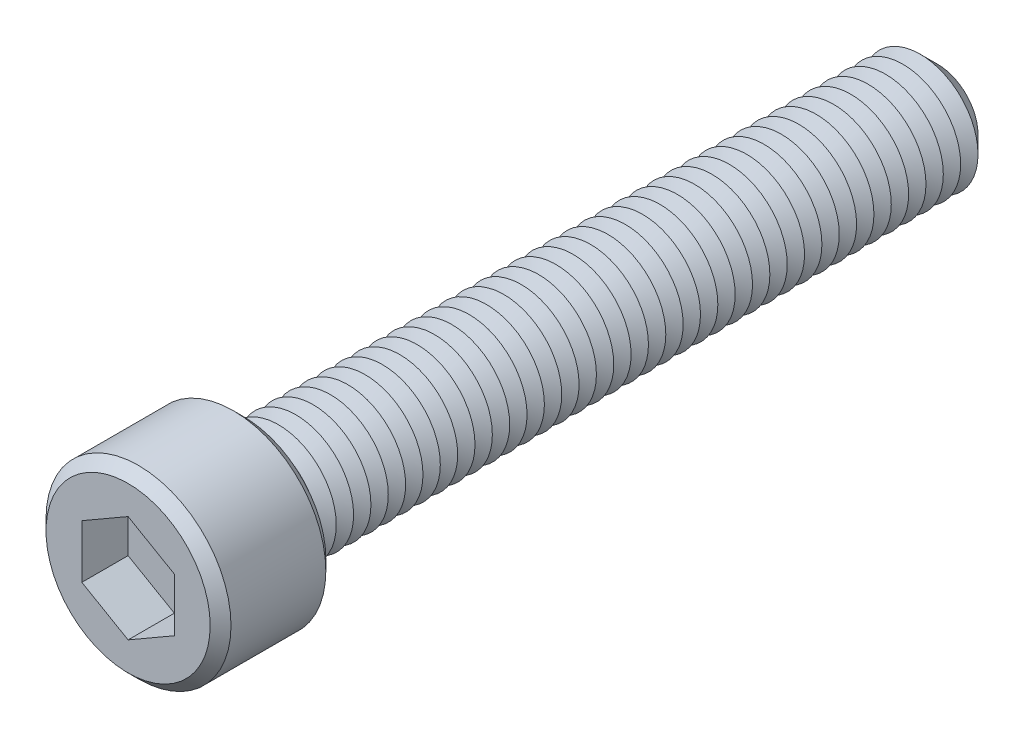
ISO-10303-21;
HEADER;
FILE_DESCRIPTION(('STEP AP214'),'2;1');
FILE_NAME('part.step','',(''),(''),'','','');
FILE_SCHEMA(('AUTOMOTIVE_DESIGN { 1 0 10303 214 1 1 1 1 }'));
ENDSEC;
DATA;
#1=APPLICATION_CONTEXT('core data for automotive mechanical design processes');
#2=APPLICATION_PROTOCOL_DEFINITION('international standard','automotive_design',2000,#1);
#3=PRODUCT_CONTEXT('',#1,'mechanical');
#4=PRODUCT('Part','Part','',(#3));
#5=PRODUCT_RELATED_PRODUCT_CATEGORY('part','',(#4));
#6=PRODUCT_DEFINITION_FORMATION('','',#4);
#7=PRODUCT_DEFINITION_CONTEXT('part definition',#1,'design');
#8=PRODUCT_DEFINITION('design','',#6,#7);
#9=PRODUCT_DEFINITION_SHAPE('','',#8);
#10=(LENGTH_UNIT() NAMED_UNIT(*) SI_UNIT(.MILLI.,.METRE.));
#11=(NAMED_UNIT(*) PLANE_ANGLE_UNIT() SI_UNIT($,.RADIAN.));
#12=(NAMED_UNIT(*) SI_UNIT($,.STERADIAN.) SOLID_ANGLE_UNIT());
#13=UNCERTAINTY_MEASURE_WITH_UNIT(LENGTH_MEASURE(1.E-05),#10,'distance_accuracy_value','');
#14=(GEOMETRIC_REPRESENTATION_CONTEXT(3) GLOBAL_UNCERTAINTY_ASSIGNED_CONTEXT((#13)) GLOBAL_UNIT_ASSIGNED_CONTEXT((#10,
#11,#12)) REPRESENTATION_CONTEXT('',''));
#15=CARTESIAN_POINT('',(0.,0.,0.));
#16=DIRECTION('',(0.,0.,1.));
#17=DIRECTION('',(1.,0.,0.));
#18=AXIS2_PLACEMENT_3D('',#15,#16,#17);
#19=CARTESIAN_POINT('',(0.,0.,10.));
#20=DIRECTION('',(0.,0.,-1.));
#21=DIRECTION('',(-1.,0.,0.));
#22=AXIS2_PLACEMENT_3D('',#19,#20,#21);
#23=CYLINDRICAL_SURFACE('',#22,8.);
#24=CARTESIAN_POINT('',(0.,0.,0.900000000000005));
#25=DIRECTION('',(0.,0.,1.));
#26=DIRECTION('',(1.,0.,0.));
#27=AXIS2_PLACEMENT_3D('',#24,#25,#26);
#28=CIRCLE('',#27,8.);
#29=CARTESIAN_POINT('',(8.,0.,0.900000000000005));
#30=VERTEX_POINT('',#29);
#31=EDGE_CURVE('E488',#30,#30,#28,.T.);
#32=ORIENTED_EDGE('',*,*,#31,.T.);
#33=EDGE_LOOP('',(#32));
#34=FACE_BOUND('',#33,.T.);
#35=CARTESIAN_POINT('',(0.,0.,9.10000000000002));
#36=DIRECTION('',(0.,0.,1.));
#37=DIRECTION('',(1.,0.,0.));
#38=AXIS2_PLACEMENT_3D('',#35,#36,#37);
#39=CIRCLE('',#38,8.);
#40=CARTESIAN_POINT('',(8.,0.,9.10000000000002));
#41=VERTEX_POINT('',#40);
#42=EDGE_CURVE('E484',#41,#41,#39,.F.);
#43=ORIENTED_EDGE('',*,*,#42,.T.);
#44=EDGE_LOOP('',(#43));
#45=FACE_BOUND('',#44,.T.);
#46=ADVANCED_FACE('F39',(#34,#45),#23,.T.);
#47=CARTESIAN_POINT('',(0.,0.,10.));
#48=DIRECTION('',(0.,0.,1.));
#49=DIRECTION('',(1.,0.,0.));
#50=AXIS2_PLACEMENT_3D('',#47,#48,#49);
#51=PLANE('',#50);
#52=CARTESIAN_POINT('',(0.,0.,10.));
#53=DIRECTION('',(0.,0.,1.));
#54=DIRECTION('',(1.,0.,0.));
#55=AXIS2_PLACEMENT_3D('',#52,#53,#54);
#56=CIRCLE('',#55,7.10000000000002);
#57=CARTESIAN_POINT('',(7.10000000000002,0.,10.));
#58=VERTEX_POINT('',#57);
#59=EDGE_CURVE('E11',#58,#58,#56,.T.);
#60=ORIENTED_EDGE('',*,*,#59,.T.);
#61=EDGE_LOOP('',(#60));
#62=FACE_BOUND('',#61,.T.);
#63=DIRECTION('',(-0.866025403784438,0.5,0.));
#64=VECTOR('',#63,1.);
#65=CARTESIAN_POINT('',(4.,2.3094010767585,10.));
#66=LINE('',#65,#64);
#67=CARTESIAN_POINT('',(4.,2.3094010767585,10.));
#68=VERTEX_POINT('',#67);
#69=CARTESIAN_POINT('',(0.,4.61880215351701,10.));
#70=VERTEX_POINT('',#69);
#71=EDGE_CURVE('E55',#68,#70,#66,.T.);
#72=ORIENTED_EDGE('',*,*,#71,.F.);
#73=DIRECTION('',(0.,1.,0.));
#74=VECTOR('',#73,1.);
#75=CARTESIAN_POINT('',(4.,-2.30940107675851,10.));
#76=LINE('',#75,#74);
#77=CARTESIAN_POINT('',(4.,-2.30940107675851,10.));
#78=VERTEX_POINT('',#77);
#79=EDGE_CURVE('E151',#78,#68,#76,.T.);
#80=ORIENTED_EDGE('',*,*,#79,.F.);
#81=DIRECTION('',(0.866025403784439,0.5,0.));
#82=VECTOR('',#81,1.);
#83=CARTESIAN_POINT('',(0.,-4.61880215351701,10.));
#84=LINE('',#83,#82);
#85=CARTESIAN_POINT('',(0.,-4.61880215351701,10.));
#86=VERTEX_POINT('',#85);
#87=EDGE_CURVE('E148',#86,#78,#84,.T.);
#88=ORIENTED_EDGE('',*,*,#87,.F.);
#89=DIRECTION('',(0.866025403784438,-0.5,0.));
#90=VECTOR('',#89,1.);
#91=CARTESIAN_POINT('',(-4.,-2.3094010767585,10.));
#92=LINE('',#91,#90);
#93=CARTESIAN_POINT('',(-4.,-2.3094010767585,10.));
#94=VERTEX_POINT('',#93);
#95=EDGE_CURVE('E103',#94,#86,#92,.T.);
#96=ORIENTED_EDGE('',*,*,#95,.F.);
#97=DIRECTION('',(0.,-1.,0.));
#98=VECTOR('',#97,1.);
#99=CARTESIAN_POINT('',(-4.,2.3094010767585,10.));
#100=LINE('',#99,#98);
#101=CARTESIAN_POINT('',(-4.,2.3094010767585,10.));
#102=VERTEX_POINT('',#101);
#103=EDGE_CURVE('E142',#102,#94,#100,.T.);
#104=ORIENTED_EDGE('',*,*,#103,.F.);
#105=DIRECTION('',(-0.866025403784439,-0.5,0.));
#106=VECTOR('',#105,1.);
#107=CARTESIAN_POINT('',(0.,4.61880215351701,10.));
#108=LINE('',#107,#106);
#109=EDGE_CURVE('E137',#70,#102,#108,.T.);
#110=ORIENTED_EDGE('',*,*,#109,.F.);
#111=EDGE_LOOP('',(#72,#80,#88,#96,#104,#110));
#112=FACE_BOUND('',#111,.T.);
#113=ADVANCED_FACE('F506',(#62,#112),#51,.T.);
#114=CARTESIAN_POINT('',(0.,0.,0.));
#115=DIRECTION('',(0.,0.,1.));
#116=DIRECTION('',(1.,0.,0.));
#117=AXIS2_PLACEMENT_3D('',#114,#115,#116);
#118=PLANE('',#117);
#119=CARTESIAN_POINT('',(0.,0.,0.));
#120=DIRECTION('',(0.,0.,1.));
#121=DIRECTION('',(1.,0.,0.));
#122=AXIS2_PLACEMENT_3D('',#119,#120,#121);
#123=CIRCLE('',#122,7.1);
#124=CARTESIAN_POINT('',(7.1,0.,0.));
#125=VERTEX_POINT('',#124);
#126=EDGE_CURVE('E48',#125,#125,#123,.F.);
#127=ORIENTED_EDGE('',*,*,#126,.T.);
#128=EDGE_LOOP('',(#127));
#129=FACE_BOUND('',#128,.T.);
#130=CARTESIAN_POINT('',(0.,0.,0.));
#131=DIRECTION('',(0.,0.,1.));
#132=DIRECTION('',(1.,0.,0.));
#133=AXIS2_PLACEMENT_3D('',#130,#131,#132);
#134=CIRCLE('',#133,5.);
#135=CARTESIAN_POINT('',(5.,0.,0.));
#136=VERTEX_POINT('',#135);
#137=EDGE_CURVE('E476',#136,#136,#134,.T.);
#138=ORIENTED_EDGE('',*,*,#137,.T.);
#139=EDGE_LOOP('',(#138));
#140=FACE_BOUND('',#139,.T.);
#141=ADVANCED_FACE('F495',(#129,#140),#118,.F.);
#142=CARTESIAN_POINT('',(0.,0.,0.));
#143=DIRECTION('',(0.,0.,1.));
#144=DIRECTION('',(1.,0.,0.));
#145=AXIS2_PLACEMENT_3D('',#142,#143,#144);
#146=CONICAL_SURFACE('',#145,5.,1.0471975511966);
#147=CARTESIAN_POINT('',(0.,0.,-0.75));
#148=DIRECTION('',(0.,0.,1.));
#149=DIRECTION('',(1.,0.,0.));
#150=AXIS2_PLACEMENT_3D('',#147,#148,#149);
#151=CIRCLE('',#150,3.70096189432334);
#152=CARTESIAN_POINT('',(3.70096189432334,0.,-0.75));
#153=VERTEX_POINT('',#152);
#154=EDGE_CURVE('E472',#153,#153,#151,.T.);
#155=ORIENTED_EDGE('',*,*,#154,.T.);
#156=EDGE_LOOP('',(#155));
#157=FACE_BOUND('',#156,.T.);
#158=ORIENTED_EDGE('',*,*,#137,.F.);
#159=EDGE_LOOP('',(#158));
#160=FACE_BOUND('',#159,.T.);
#161=ADVANCED_FACE('F868',(#157,#160),#146,.T.);
#162=CARTESIAN_POINT('',(0.,0.,-0.75));
#163=DIRECTION('',(0.,0.,-1.));
#164=DIRECTION('',(-1.,0.,0.));
#165=AXIS2_PLACEMENT_3D('',#162,#163,#164);
#166=CONICAL_SURFACE('',#165,3.70096189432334,1.0471975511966);
#167=CARTESIAN_POINT('',(0.,0.,-1.5));
#168=DIRECTION('',(0.,0.,1.));
#169=DIRECTION('',(1.,0.,0.));
#170=AXIS2_PLACEMENT_3D('',#167,#168,#169);
#171=CIRCLE('',#170,5.);
#172=CARTESIAN_POINT('',(5.,0.,-1.5));
#173=VERTEX_POINT('',#172);
#174=EDGE_CURVE('E468',#173,#173,#171,.T.);
#175=ORIENTED_EDGE('',*,*,#174,.T.);
#176=EDGE_LOOP('',(#175));
#177=FACE_BOUND('',#176,.T.);
#178=ORIENTED_EDGE('',*,*,#154,.F.);
#179=EDGE_LOOP('',(#178));
#180=FACE_BOUND('',#179,.T.);
#181=ADVANCED_FACE('F864',(#177,#180),#166,.T.);
#182=CARTESIAN_POINT('',(0.,0.,-1.5));
#183=DIRECTION('',(0.,0.,1.));
#184=DIRECTION('',(1.,0.,0.));
#185=AXIS2_PLACEMENT_3D('',#182,#183,#184);
#186=CONICAL_SURFACE('',#185,5.,1.0471975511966);
#187=CARTESIAN_POINT('',(0.,0.,-2.25));
#188=DIRECTION('',(0.,0.,1.));
#189=DIRECTION('',(1.,0.,0.));
#190=AXIS2_PLACEMENT_3D('',#187,#188,#189);
#191=CIRCLE('',#190,3.70096189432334);
#192=CARTESIAN_POINT('',(3.70096189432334,0.,-2.25));
#193=VERTEX_POINT('',#192);
#194=EDGE_CURVE('E464',#193,#193,#191,.T.);
#195=ORIENTED_EDGE('',*,*,#194,.T.);
#196=EDGE_LOOP('',(#195));
#197=FACE_BOUND('',#196,.T.);
#198=ORIENTED_EDGE('',*,*,#174,.F.);
#199=EDGE_LOOP('',(#198));
#200=FACE_BOUND('',#199,.T.);
#201=ADVANCED_FACE('F860',(#197,#200),#186,.T.);
#202=CARTESIAN_POINT('',(0.,0.,-2.25));
#203=DIRECTION('',(0.,0.,-1.));
#204=DIRECTION('',(-1.,0.,0.));
#205=AXIS2_PLACEMENT_3D('',#202,#203,#204);
#206=CONICAL_SURFACE('',#205,3.70096189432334,1.0471975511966);
#207=CARTESIAN_POINT('',(0.,0.,-3.));
#208=DIRECTION('',(0.,0.,1.));
#209=DIRECTION('',(1.,0.,0.));
#210=AXIS2_PLACEMENT_3D('',#207,#208,#209);
#211=CIRCLE('',#210,5.);
#212=CARTESIAN_POINT('',(5.,0.,-3.));
#213=VERTEX_POINT('',#212);
#214=EDGE_CURVE('E460',#213,#213,#211,.T.);
#215=ORIENTED_EDGE('',*,*,#214,.T.);
#216=EDGE_LOOP('',(#215));
#217=FACE_BOUND('',#216,.T.);
#218=ORIENTED_EDGE('',*,*,#194,.F.);
#219=EDGE_LOOP('',(#218));
#220=FACE_BOUND('',#219,.T.);
#221=ADVANCED_FACE('F856',(#217,#220),#206,.T.);
#222=CARTESIAN_POINT('',(0.,0.,-3.));
#223=DIRECTION('',(0.,0.,1.));
#224=DIRECTION('',(1.,0.,0.));
#225=AXIS2_PLACEMENT_3D('',#222,#223,#224);
#226=CONICAL_SURFACE('',#225,5.,1.0471975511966);
#227=CARTESIAN_POINT('',(0.,0.,-3.75));
#228=DIRECTION('',(0.,0.,1.));
#229=DIRECTION('',(1.,0.,0.));
#230=AXIS2_PLACEMENT_3D('',#227,#228,#229);
#231=CIRCLE('',#230,3.70096189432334);
#232=CARTESIAN_POINT('',(3.70096189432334,0.,-3.75));
#233=VERTEX_POINT('',#232);
#234=EDGE_CURVE('E456',#233,#233,#231,.T.);
#235=ORIENTED_EDGE('',*,*,#234,.T.);
#236=EDGE_LOOP('',(#235));
#237=FACE_BOUND('',#236,.T.);
#238=ORIENTED_EDGE('',*,*,#214,.F.);
#239=EDGE_LOOP('',(#238));
#240=FACE_BOUND('',#239,.T.);
#241=ADVANCED_FACE('F852',(#237,#240),#226,.T.);
#242=CARTESIAN_POINT('',(0.,0.,-3.75));
#243=DIRECTION('',(0.,0.,-1.));
#244=DIRECTION('',(-1.,0.,0.));
#245=AXIS2_PLACEMENT_3D('',#242,#243,#244);
#246=CONICAL_SURFACE('',#245,3.70096189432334,1.0471975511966);
#247=CARTESIAN_POINT('',(0.,0.,-4.5));
#248=DIRECTION('',(0.,0.,1.));
#249=DIRECTION('',(1.,0.,0.));
#250=AXIS2_PLACEMENT_3D('',#247,#248,#249);
#251=CIRCLE('',#250,5.);
#252=CARTESIAN_POINT('',(5.,0.,-4.5));
#253=VERTEX_POINT('',#252);
#254=EDGE_CURVE('E452',#253,#253,#251,.T.);
#255=ORIENTED_EDGE('',*,*,#254,.T.);
#256=EDGE_LOOP('',(#255));
#257=FACE_BOUND('',#256,.T.);
#258=ORIENTED_EDGE('',*,*,#234,.F.);
#259=EDGE_LOOP('',(#258));
#260=FACE_BOUND('',#259,.T.);
#261=ADVANCED_FACE('F848',(#257,#260),#246,.T.);
#262=CARTESIAN_POINT('',(0.,0.,-4.5));
#263=DIRECTION('',(0.,0.,1.));
#264=DIRECTION('',(1.,0.,0.));
#265=AXIS2_PLACEMENT_3D('',#262,#263,#264);
#266=CONICAL_SURFACE('',#265,5.,1.0471975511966);
#267=CARTESIAN_POINT('',(0.,0.,-5.25));
#268=DIRECTION('',(0.,0.,1.));
#269=DIRECTION('',(1.,0.,0.));
#270=AXIS2_PLACEMENT_3D('',#267,#268,#269);
#271=CIRCLE('',#270,3.70096189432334);
#272=CARTESIAN_POINT('',(3.70096189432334,0.,-5.25));
#273=VERTEX_POINT('',#272);
#274=EDGE_CURVE('E448',#273,#273,#271,.T.);
#275=ORIENTED_EDGE('',*,*,#274,.T.);
#276=EDGE_LOOP('',(#275));
#277=FACE_BOUND('',#276,.T.);
#278=ORIENTED_EDGE('',*,*,#254,.F.);
#279=EDGE_LOOP('',(#278));
#280=FACE_BOUND('',#279,.T.);
#281=ADVANCED_FACE('F844',(#277,#280),#266,.T.);
#282=CARTESIAN_POINT('',(0.,0.,-5.25));
#283=DIRECTION('',(0.,0.,-1.));
#284=DIRECTION('',(-1.,0.,0.));
#285=AXIS2_PLACEMENT_3D('',#282,#283,#284);
#286=CONICAL_SURFACE('',#285,3.70096189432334,1.0471975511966);
#287=CARTESIAN_POINT('',(0.,0.,-6.));
#288=DIRECTION('',(0.,0.,1.));
#289=DIRECTION('',(1.,0.,0.));
#290=AXIS2_PLACEMENT_3D('',#287,#288,#289);
#291=CIRCLE('',#290,5.);
#292=CARTESIAN_POINT('',(5.,0.,-6.));
#293=VERTEX_POINT('',#292);
#294=EDGE_CURVE('E444',#293,#293,#291,.T.);
#295=ORIENTED_EDGE('',*,*,#294,.T.);
#296=EDGE_LOOP('',(#295));
#297=FACE_BOUND('',#296,.T.);
#298=ORIENTED_EDGE('',*,*,#274,.F.);
#299=EDGE_LOOP('',(#298));
#300=FACE_BOUND('',#299,.T.);
#301=ADVANCED_FACE('F840',(#297,#300),#286,.T.);
#302=CARTESIAN_POINT('',(0.,0.,-6.));
#303=DIRECTION('',(0.,0.,1.));
#304=DIRECTION('',(1.,0.,0.));
#305=AXIS2_PLACEMENT_3D('',#302,#303,#304);
#306=CONICAL_SURFACE('',#305,5.,1.0471975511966);
#307=CARTESIAN_POINT('',(0.,0.,-6.75));
#308=DIRECTION('',(0.,0.,1.));
#309=DIRECTION('',(1.,0.,0.));
#310=AXIS2_PLACEMENT_3D('',#307,#308,#309);
#311=CIRCLE('',#310,3.70096189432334);
#312=CARTESIAN_POINT('',(3.70096189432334,0.,-6.75));
#313=VERTEX_POINT('',#312);
#314=EDGE_CURVE('E440',#313,#313,#311,.T.);
#315=ORIENTED_EDGE('',*,*,#314,.T.);
#316=EDGE_LOOP('',(#315));
#317=FACE_BOUND('',#316,.T.);
#318=ORIENTED_EDGE('',*,*,#294,.F.);
#319=EDGE_LOOP('',(#318));
#320=FACE_BOUND('',#319,.T.);
#321=ADVANCED_FACE('F836',(#317,#320),#306,.T.);
#322=CARTESIAN_POINT('',(0.,0.,-6.75));
#323=DIRECTION('',(0.,0.,-1.));
#324=DIRECTION('',(-1.,0.,0.));
#325=AXIS2_PLACEMENT_3D('',#322,#323,#324);
#326=CONICAL_SURFACE('',#325,3.70096189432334,1.0471975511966);
#327=CARTESIAN_POINT('',(0.,0.,-7.5));
#328=DIRECTION('',(0.,0.,1.));
#329=DIRECTION('',(1.,0.,0.));
#330=AXIS2_PLACEMENT_3D('',#327,#328,#329);
#331=CIRCLE('',#330,5.);
#332=CARTESIAN_POINT('',(5.,0.,-7.5));
#333=VERTEX_POINT('',#332);
#334=EDGE_CURVE('E436',#333,#333,#331,.T.);
#335=ORIENTED_EDGE('',*,*,#334,.T.);
#336=EDGE_LOOP('',(#335));
#337=FACE_BOUND('',#336,.T.);
#338=ORIENTED_EDGE('',*,*,#314,.F.);
#339=EDGE_LOOP('',(#338));
#340=FACE_BOUND('',#339,.T.);
#341=ADVANCED_FACE('F832',(#337,#340),#326,.T.);
#342=CARTESIAN_POINT('',(0.,0.,-7.5));
#343=DIRECTION('',(0.,0.,1.));
#344=DIRECTION('',(1.,0.,0.));
#345=AXIS2_PLACEMENT_3D('',#342,#343,#344);
#346=CONICAL_SURFACE('',#345,5.,1.0471975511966);
#347=CARTESIAN_POINT('',(0.,0.,-8.25));
#348=DIRECTION('',(0.,0.,1.));
#349=DIRECTION('',(1.,0.,0.));
#350=AXIS2_PLACEMENT_3D('',#347,#348,#349);
#351=CIRCLE('',#350,3.70096189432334);
#352=CARTESIAN_POINT('',(3.70096189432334,0.,-8.25));
#353=VERTEX_POINT('',#352);
#354=EDGE_CURVE('E432',#353,#353,#351,.T.);
#355=ORIENTED_EDGE('',*,*,#354,.T.);
#356=EDGE_LOOP('',(#355));
#357=FACE_BOUND('',#356,.T.);
#358=ORIENTED_EDGE('',*,*,#334,.F.);
#359=EDGE_LOOP('',(#358));
#360=FACE_BOUND('',#359,.T.);
#361=ADVANCED_FACE('F828',(#357,#360),#346,.T.);
#362=CARTESIAN_POINT('',(0.,0.,-8.25));
#363=DIRECTION('',(0.,0.,-1.));
#364=DIRECTION('',(-1.,0.,0.));
#365=AXIS2_PLACEMENT_3D('',#362,#363,#364);
#366=CONICAL_SURFACE('',#365,3.70096189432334,1.0471975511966);
#367=CARTESIAN_POINT('',(0.,0.,-9.));
#368=DIRECTION('',(0.,0.,1.));
#369=DIRECTION('',(1.,0.,0.));
#370=AXIS2_PLACEMENT_3D('',#367,#368,#369);
#371=CIRCLE('',#370,5.);
#372=CARTESIAN_POINT('',(5.,0.,-9.));
#373=VERTEX_POINT('',#372);
#374=EDGE_CURVE('E428',#373,#373,#371,.T.);
#375=ORIENTED_EDGE('',*,*,#374,.T.);
#376=EDGE_LOOP('',(#375));
#377=FACE_BOUND('',#376,.T.);
#378=ORIENTED_EDGE('',*,*,#354,.F.);
#379=EDGE_LOOP('',(#378));
#380=FACE_BOUND('',#379,.T.);
#381=ADVANCED_FACE('F824',(#377,#380),#366,.T.);
#382=CARTESIAN_POINT('',(0.,0.,-9.));
#383=DIRECTION('',(0.,0.,1.));
#384=DIRECTION('',(1.,0.,0.));
#385=AXIS2_PLACEMENT_3D('',#382,#383,#384);
#386=CONICAL_SURFACE('',#385,5.,1.0471975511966);
#387=CARTESIAN_POINT('',(0.,0.,-9.75));
#388=DIRECTION('',(0.,0.,1.));
#389=DIRECTION('',(1.,0.,0.));
#390=AXIS2_PLACEMENT_3D('',#387,#388,#389);
#391=CIRCLE('',#390,3.70096189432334);
#392=CARTESIAN_POINT('',(3.70096189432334,0.,-9.75));
#393=VERTEX_POINT('',#392);
#394=EDGE_CURVE('E424',#393,#393,#391,.T.);
#395=ORIENTED_EDGE('',*,*,#394,.T.);
#396=EDGE_LOOP('',(#395));
#397=FACE_BOUND('',#396,.T.);
#398=ORIENTED_EDGE('',*,*,#374,.F.);
#399=EDGE_LOOP('',(#398));
#400=FACE_BOUND('',#399,.T.);
#401=ADVANCED_FACE('F820',(#397,#400),#386,.T.);
#402=CARTESIAN_POINT('',(0.,0.,-9.75));
#403=DIRECTION('',(0.,0.,-1.));
#404=DIRECTION('',(-1.,0.,0.));
#405=AXIS2_PLACEMENT_3D('',#402,#403,#404);
#406=CONICAL_SURFACE('',#405,3.70096189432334,1.0471975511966);
#407=CARTESIAN_POINT('',(0.,0.,-10.5));
#408=DIRECTION('',(0.,0.,1.));
#409=DIRECTION('',(1.,0.,0.));
#410=AXIS2_PLACEMENT_3D('',#407,#408,#409);
#411=CIRCLE('',#410,5.);
#412=CARTESIAN_POINT('',(5.,0.,-10.5));
#413=VERTEX_POINT('',#412);
#414=EDGE_CURVE('E420',#413,#413,#411,.T.);
#415=ORIENTED_EDGE('',*,*,#414,.T.);
#416=EDGE_LOOP('',(#415));
#417=FACE_BOUND('',#416,.T.);
#418=ORIENTED_EDGE('',*,*,#394,.F.);
#419=EDGE_LOOP('',(#418));
#420=FACE_BOUND('',#419,.T.);
#421=ADVANCED_FACE('F816',(#417,#420),#406,.T.);
#422=CARTESIAN_POINT('',(0.,0.,-10.5));
#423=DIRECTION('',(0.,0.,1.));
#424=DIRECTION('',(1.,0.,0.));
#425=AXIS2_PLACEMENT_3D('',#422,#423,#424);
#426=CONICAL_SURFACE('',#425,5.,1.0471975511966);
#427=CARTESIAN_POINT('',(0.,0.,-11.25));
#428=DIRECTION('',(0.,0.,1.));
#429=DIRECTION('',(1.,0.,0.));
#430=AXIS2_PLACEMENT_3D('',#427,#428,#429);
#431=CIRCLE('',#430,3.70096189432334);
#432=CARTESIAN_POINT('',(3.70096189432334,0.,-11.25));
#433=VERTEX_POINT('',#432);
#434=EDGE_CURVE('E416',#433,#433,#431,.T.);
#435=ORIENTED_EDGE('',*,*,#434,.T.);
#436=EDGE_LOOP('',(#435));
#437=FACE_BOUND('',#436,.T.);
#438=ORIENTED_EDGE('',*,*,#414,.F.);
#439=EDGE_LOOP('',(#438));
#440=FACE_BOUND('',#439,.T.);
#441=ADVANCED_FACE('F812',(#437,#440),#426,.T.);
#442=CARTESIAN_POINT('',(0.,0.,-11.25));
#443=DIRECTION('',(0.,0.,-1.));
#444=DIRECTION('',(-1.,0.,0.));
#445=AXIS2_PLACEMENT_3D('',#442,#443,#444);
#446=CONICAL_SURFACE('',#445,3.70096189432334,1.0471975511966);
#447=CARTESIAN_POINT('',(0.,0.,-12.));
#448=DIRECTION('',(0.,0.,1.));
#449=DIRECTION('',(1.,0.,0.));
#450=AXIS2_PLACEMENT_3D('',#447,#448,#449);
#451=CIRCLE('',#450,5.);
#452=CARTESIAN_POINT('',(5.,0.,-12.));
#453=VERTEX_POINT('',#452);
#454=EDGE_CURVE('E412',#453,#453,#451,.T.);
#455=ORIENTED_EDGE('',*,*,#454,.T.);
#456=EDGE_LOOP('',(#455));
#457=FACE_BOUND('',#456,.T.);
#458=ORIENTED_EDGE('',*,*,#434,.F.);
#459=EDGE_LOOP('',(#458));
#460=FACE_BOUND('',#459,.T.);
#461=ADVANCED_FACE('F808',(#457,#460),#446,.T.);
#462=CARTESIAN_POINT('',(0.,0.,-12.));
#463=DIRECTION('',(0.,0.,1.));
#464=DIRECTION('',(1.,0.,0.));
#465=AXIS2_PLACEMENT_3D('',#462,#463,#464);
#466=CONICAL_SURFACE('',#465,5.,1.0471975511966);
#467=CARTESIAN_POINT('',(0.,0.,-12.75));
#468=DIRECTION('',(0.,0.,1.));
#469=DIRECTION('',(1.,0.,0.));
#470=AXIS2_PLACEMENT_3D('',#467,#468,#469);
#471=CIRCLE('',#470,3.70096189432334);
#472=CARTESIAN_POINT('',(3.70096189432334,0.,-12.75));
#473=VERTEX_POINT('',#472);
#474=EDGE_CURVE('E408',#473,#473,#471,.T.);
#475=ORIENTED_EDGE('',*,*,#474,.T.);
#476=EDGE_LOOP('',(#475));
#477=FACE_BOUND('',#476,.T.);
#478=ORIENTED_EDGE('',*,*,#454,.F.);
#479=EDGE_LOOP('',(#478));
#480=FACE_BOUND('',#479,.T.);
#481=ADVANCED_FACE('F804',(#477,#480),#466,.T.);
#482=CARTESIAN_POINT('',(0.,0.,-12.75));
#483=DIRECTION('',(0.,0.,-1.));
#484=DIRECTION('',(-1.,0.,0.));
#485=AXIS2_PLACEMENT_3D('',#482,#483,#484);
#486=CONICAL_SURFACE('',#485,3.70096189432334,1.0471975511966);
#487=CARTESIAN_POINT('',(0.,0.,-13.5));
#488=DIRECTION('',(0.,0.,1.));
#489=DIRECTION('',(1.,0.,0.));
#490=AXIS2_PLACEMENT_3D('',#487,#488,#489);
#491=CIRCLE('',#490,5.);
#492=CARTESIAN_POINT('',(5.,0.,-13.5));
#493=VERTEX_POINT('',#492);
#494=EDGE_CURVE('E404',#493,#493,#491,.T.);
#495=ORIENTED_EDGE('',*,*,#494,.T.);
#496=EDGE_LOOP('',(#495));
#497=FACE_BOUND('',#496,.T.);
#498=ORIENTED_EDGE('',*,*,#474,.F.);
#499=EDGE_LOOP('',(#498));
#500=FACE_BOUND('',#499,.T.);
#501=ADVANCED_FACE('F800',(#497,#500),#486,.T.);
#502=CARTESIAN_POINT('',(0.,0.,-13.5));
#503=DIRECTION('',(0.,0.,1.));
#504=DIRECTION('',(1.,0.,0.));
#505=AXIS2_PLACEMENT_3D('',#502,#503,#504);
#506=CONICAL_SURFACE('',#505,5.,1.0471975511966);
#507=CARTESIAN_POINT('',(0.,0.,-14.25));
#508=DIRECTION('',(0.,0.,1.));
#509=DIRECTION('',(1.,0.,0.));
#510=AXIS2_PLACEMENT_3D('',#507,#508,#509);
#511=CIRCLE('',#510,3.70096189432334);
#512=CARTESIAN_POINT('',(3.70096189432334,0.,-14.25));
#513=VERTEX_POINT('',#512);
#514=EDGE_CURVE('E400',#513,#513,#511,.T.);
#515=ORIENTED_EDGE('',*,*,#514,.T.);
#516=EDGE_LOOP('',(#515));
#517=FACE_BOUND('',#516,.T.);
#518=ORIENTED_EDGE('',*,*,#494,.F.);
#519=EDGE_LOOP('',(#518));
#520=FACE_BOUND('',#519,.T.);
#521=ADVANCED_FACE('F796',(#517,#520),#506,.T.);
#522=CARTESIAN_POINT('',(0.,0.,-14.25));
#523=DIRECTION('',(0.,0.,-1.));
#524=DIRECTION('',(-1.,0.,0.));
#525=AXIS2_PLACEMENT_3D('',#522,#523,#524);
#526=CONICAL_SURFACE('',#525,3.70096189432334,1.0471975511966);
#527=CARTESIAN_POINT('',(0.,0.,-15.));
#528=DIRECTION('',(0.,0.,1.));
#529=DIRECTION('',(1.,0.,0.));
#530=AXIS2_PLACEMENT_3D('',#527,#528,#529);
#531=CIRCLE('',#530,5.);
#532=CARTESIAN_POINT('',(5.,0.,-15.));
#533=VERTEX_POINT('',#532);
#534=EDGE_CURVE('E396',#533,#533,#531,.T.);
#535=ORIENTED_EDGE('',*,*,#534,.T.);
#536=EDGE_LOOP('',(#535));
#537=FACE_BOUND('',#536,.T.);
#538=ORIENTED_EDGE('',*,*,#514,.F.);
#539=EDGE_LOOP('',(#538));
#540=FACE_BOUND('',#539,.T.);
#541=ADVANCED_FACE('F792',(#537,#540),#526,.T.);
#542=CARTESIAN_POINT('',(0.,0.,-15.));
#543=DIRECTION('',(0.,0.,1.));
#544=DIRECTION('',(1.,0.,0.));
#545=AXIS2_PLACEMENT_3D('',#542,#543,#544);
#546=CONICAL_SURFACE('',#545,5.,1.0471975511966);
#547=CARTESIAN_POINT('',(0.,0.,-15.75));
#548=DIRECTION('',(0.,0.,1.));
#549=DIRECTION('',(1.,0.,0.));
#550=AXIS2_PLACEMENT_3D('',#547,#548,#549);
#551=CIRCLE('',#550,3.70096189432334);
#552=CARTESIAN_POINT('',(3.70096189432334,0.,-15.75));
#553=VERTEX_POINT('',#552);
#554=EDGE_CURVE('E392',#553,#553,#551,.T.);
#555=ORIENTED_EDGE('',*,*,#554,.T.);
#556=EDGE_LOOP('',(#555));
#557=FACE_BOUND('',#556,.T.);
#558=ORIENTED_EDGE('',*,*,#534,.F.);
#559=EDGE_LOOP('',(#558));
#560=FACE_BOUND('',#559,.T.);
#561=ADVANCED_FACE('F788',(#557,#560),#546,.T.);
#562=CARTESIAN_POINT('',(0.,0.,-15.75));
#563=DIRECTION('',(0.,0.,-1.));
#564=DIRECTION('',(-1.,0.,0.));
#565=AXIS2_PLACEMENT_3D('',#562,#563,#564);
#566=CONICAL_SURFACE('',#565,3.70096189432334,1.0471975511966);
#567=CARTESIAN_POINT('',(0.,0.,-16.5));
#568=DIRECTION('',(0.,0.,1.));
#569=DIRECTION('',(1.,0.,0.));
#570=AXIS2_PLACEMENT_3D('',#567,#568,#569);
#571=CIRCLE('',#570,5.);
#572=CARTESIAN_POINT('',(5.,0.,-16.5));
#573=VERTEX_POINT('',#572);
#574=EDGE_CURVE('E388',#573,#573,#571,.T.);
#575=ORIENTED_EDGE('',*,*,#574,.T.);
#576=EDGE_LOOP('',(#575));
#577=FACE_BOUND('',#576,.T.);
#578=ORIENTED_EDGE('',*,*,#554,.F.);
#579=EDGE_LOOP('',(#578));
#580=FACE_BOUND('',#579,.T.);
#581=ADVANCED_FACE('F784',(#577,#580),#566,.T.);
#582=CARTESIAN_POINT('',(0.,0.,-16.5));
#583=DIRECTION('',(0.,0.,1.));
#584=DIRECTION('',(1.,0.,0.));
#585=AXIS2_PLACEMENT_3D('',#582,#583,#584);
#586=CONICAL_SURFACE('',#585,5.,1.0471975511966);
#587=CARTESIAN_POINT('',(0.,0.,-17.25));
#588=DIRECTION('',(0.,0.,1.));
#589=DIRECTION('',(1.,0.,0.));
#590=AXIS2_PLACEMENT_3D('',#587,#588,#589);
#591=CIRCLE('',#590,3.70096189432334);
#592=CARTESIAN_POINT('',(3.70096189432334,0.,-17.25));
#593=VERTEX_POINT('',#592);
#594=EDGE_CURVE('E384',#593,#593,#591,.T.);
#595=ORIENTED_EDGE('',*,*,#594,.T.);
#596=EDGE_LOOP('',(#595));
#597=FACE_BOUND('',#596,.T.);
#598=ORIENTED_EDGE('',*,*,#574,.F.);
#599=EDGE_LOOP('',(#598));
#600=FACE_BOUND('',#599,.T.);
#601=ADVANCED_FACE('F780',(#597,#600),#586,.T.);
#602=CARTESIAN_POINT('',(0.,0.,-17.25));
#603=DIRECTION('',(0.,0.,-1.));
#604=DIRECTION('',(-1.,0.,0.));
#605=AXIS2_PLACEMENT_3D('',#602,#603,#604);
#606=CONICAL_SURFACE('',#605,3.70096189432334,1.0471975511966);
#607=CARTESIAN_POINT('',(0.,0.,-18.));
#608=DIRECTION('',(0.,0.,1.));
#609=DIRECTION('',(1.,0.,0.));
#610=AXIS2_PLACEMENT_3D('',#607,#608,#609);
#611=CIRCLE('',#610,5.);
#612=CARTESIAN_POINT('',(5.,0.,-18.));
#613=VERTEX_POINT('',#612);
#614=EDGE_CURVE('E380',#613,#613,#611,.T.);
#615=ORIENTED_EDGE('',*,*,#614,.T.);
#616=EDGE_LOOP('',(#615));
#617=FACE_BOUND('',#616,.T.);
#618=ORIENTED_EDGE('',*,*,#594,.F.);
#619=EDGE_LOOP('',(#618));
#620=FACE_BOUND('',#619,.T.);
#621=ADVANCED_FACE('F776',(#617,#620),#606,.T.);
#622=CARTESIAN_POINT('',(0.,0.,-18.));
#623=DIRECTION('',(0.,0.,1.));
#624=DIRECTION('',(1.,0.,0.));
#625=AXIS2_PLACEMENT_3D('',#622,#623,#624);
#626=CONICAL_SURFACE('',#625,5.,1.0471975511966);
#627=CARTESIAN_POINT('',(0.,0.,-18.75));
#628=DIRECTION('',(0.,0.,1.));
#629=DIRECTION('',(1.,0.,0.));
#630=AXIS2_PLACEMENT_3D('',#627,#628,#629);
#631=CIRCLE('',#630,3.70096189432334);
#632=CARTESIAN_POINT('',(3.70096189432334,0.,-18.75));
#633=VERTEX_POINT('',#632);
#634=EDGE_CURVE('E376',#633,#633,#631,.T.);
#635=ORIENTED_EDGE('',*,*,#634,.T.);
#636=EDGE_LOOP('',(#635));
#637=FACE_BOUND('',#636,.T.);
#638=ORIENTED_EDGE('',*,*,#614,.F.);
#639=EDGE_LOOP('',(#638));
#640=FACE_BOUND('',#639,.T.);
#641=ADVANCED_FACE('F772',(#637,#640),#626,.T.);
#642=CARTESIAN_POINT('',(0.,0.,-18.75));
#643=DIRECTION('',(0.,0.,-1.));
#644=DIRECTION('',(-1.,0.,0.));
#645=AXIS2_PLACEMENT_3D('',#642,#643,#644);
#646=CONICAL_SURFACE('',#645,3.70096189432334,1.0471975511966);
#647=CARTESIAN_POINT('',(0.,0.,-19.5));
#648=DIRECTION('',(0.,0.,1.));
#649=DIRECTION('',(1.,0.,0.));
#650=AXIS2_PLACEMENT_3D('',#647,#648,#649);
#651=CIRCLE('',#650,5.);
#652=CARTESIAN_POINT('',(5.,0.,-19.5));
#653=VERTEX_POINT('',#652);
#654=EDGE_CURVE('E372',#653,#653,#651,.T.);
#655=ORIENTED_EDGE('',*,*,#654,.T.);
#656=EDGE_LOOP('',(#655));
#657=FACE_BOUND('',#656,.T.);
#658=ORIENTED_EDGE('',*,*,#634,.F.);
#659=EDGE_LOOP('',(#658));
#660=FACE_BOUND('',#659,.T.);
#661=ADVANCED_FACE('F768',(#657,#660),#646,.T.);
#662=CARTESIAN_POINT('',(0.,0.,-19.5));
#663=DIRECTION('',(0.,0.,1.));
#664=DIRECTION('',(1.,0.,0.));
#665=AXIS2_PLACEMENT_3D('',#662,#663,#664);
#666=CONICAL_SURFACE('',#665,5.,1.0471975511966);
#667=CARTESIAN_POINT('',(0.,0.,-20.25));
#668=DIRECTION('',(0.,0.,1.));
#669=DIRECTION('',(1.,0.,0.));
#670=AXIS2_PLACEMENT_3D('',#667,#668,#669);
#671=CIRCLE('',#670,3.70096189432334);
#672=CARTESIAN_POINT('',(3.70096189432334,0.,-20.25));
#673=VERTEX_POINT('',#672);
#674=EDGE_CURVE('E368',#673,#673,#671,.T.);
#675=ORIENTED_EDGE('',*,*,#674,.T.);
#676=EDGE_LOOP('',(#675));
#677=FACE_BOUND('',#676,.T.);
#678=ORIENTED_EDGE('',*,*,#654,.F.);
#679=EDGE_LOOP('',(#678));
#680=FACE_BOUND('',#679,.T.);
#681=ADVANCED_FACE('F764',(#677,#680),#666,.T.);
#682=CARTESIAN_POINT('',(0.,0.,-20.25));
#683=DIRECTION('',(0.,0.,-1.));
#684=DIRECTION('',(-1.,0.,0.));
#685=AXIS2_PLACEMENT_3D('',#682,#683,#684);
#686=CONICAL_SURFACE('',#685,3.70096189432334,1.0471975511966);
#687=CARTESIAN_POINT('',(0.,0.,-21.));
#688=DIRECTION('',(0.,0.,1.));
#689=DIRECTION('',(1.,0.,0.));
#690=AXIS2_PLACEMENT_3D('',#687,#688,#689);
#691=CIRCLE('',#690,5.);
#692=CARTESIAN_POINT('',(5.,0.,-21.));
#693=VERTEX_POINT('',#692);
#694=EDGE_CURVE('E364',#693,#693,#691,.T.);
#695=ORIENTED_EDGE('',*,*,#694,.T.);
#696=EDGE_LOOP('',(#695));
#697=FACE_BOUND('',#696,.T.);
#698=ORIENTED_EDGE('',*,*,#674,.F.);
#699=EDGE_LOOP('',(#698));
#700=FACE_BOUND('',#699,.T.);
#701=ADVANCED_FACE('F760',(#697,#700),#686,.T.);
#702=CARTESIAN_POINT('',(0.,0.,-21.));
#703=DIRECTION('',(0.,0.,1.));
#704=DIRECTION('',(1.,0.,0.));
#705=AXIS2_PLACEMENT_3D('',#702,#703,#704);
#706=CONICAL_SURFACE('',#705,5.,1.0471975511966);
#707=CARTESIAN_POINT('',(0.,0.,-21.75));
#708=DIRECTION('',(0.,0.,1.));
#709=DIRECTION('',(1.,0.,0.));
#710=AXIS2_PLACEMENT_3D('',#707,#708,#709);
#711=CIRCLE('',#710,3.70096189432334);
#712=CARTESIAN_POINT('',(3.70096189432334,0.,-21.75));
#713=VERTEX_POINT('',#712);
#714=EDGE_CURVE('E360',#713,#713,#711,.T.);
#715=ORIENTED_EDGE('',*,*,#714,.T.);
#716=EDGE_LOOP('',(#715));
#717=FACE_BOUND('',#716,.T.);
#718=ORIENTED_EDGE('',*,*,#694,.F.);
#719=EDGE_LOOP('',(#718));
#720=FACE_BOUND('',#719,.T.);
#721=ADVANCED_FACE('F756',(#717,#720),#706,.T.);
#722=CARTESIAN_POINT('',(0.,0.,-21.75));
#723=DIRECTION('',(0.,0.,-1.));
#724=DIRECTION('',(-1.,0.,0.));
#725=AXIS2_PLACEMENT_3D('',#722,#723,#724);
#726=CONICAL_SURFACE('',#725,3.70096189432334,1.0471975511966);
#727=CARTESIAN_POINT('',(0.,0.,-22.5));
#728=DIRECTION('',(0.,0.,1.));
#729=DIRECTION('',(1.,0.,0.));
#730=AXIS2_PLACEMENT_3D('',#727,#728,#729);
#731=CIRCLE('',#730,5.);
#732=CARTESIAN_POINT('',(5.,0.,-22.5));
#733=VERTEX_POINT('',#732);
#734=EDGE_CURVE('E356',#733,#733,#731,.T.);
#735=ORIENTED_EDGE('',*,*,#734,.T.);
#736=EDGE_LOOP('',(#735));
#737=FACE_BOUND('',#736,.T.);
#738=ORIENTED_EDGE('',*,*,#714,.F.);
#739=EDGE_LOOP('',(#738));
#740=FACE_BOUND('',#739,.T.);
#741=ADVANCED_FACE('F752',(#737,#740),#726,.T.);
#742=CARTESIAN_POINT('',(0.,0.,-22.5));
#743=DIRECTION('',(0.,0.,1.));
#744=DIRECTION('',(1.,0.,0.));
#745=AXIS2_PLACEMENT_3D('',#742,#743,#744);
#746=CONICAL_SURFACE('',#745,5.,1.0471975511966);
#747=CARTESIAN_POINT('',(0.,0.,-23.25));
#748=DIRECTION('',(0.,0.,1.));
#749=DIRECTION('',(1.,0.,0.));
#750=AXIS2_PLACEMENT_3D('',#747,#748,#749);
#751=CIRCLE('',#750,3.70096189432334);
#752=CARTESIAN_POINT('',(3.70096189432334,0.,-23.25));
#753=VERTEX_POINT('',#752);
#754=EDGE_CURVE('E352',#753,#753,#751,.T.);
#755=ORIENTED_EDGE('',*,*,#754,.T.);
#756=EDGE_LOOP('',(#755));
#757=FACE_BOUND('',#756,.T.);
#758=ORIENTED_EDGE('',*,*,#734,.F.);
#759=EDGE_LOOP('',(#758));
#760=FACE_BOUND('',#759,.T.);
#761=ADVANCED_FACE('F748',(#757,#760),#746,.T.);
#762=CARTESIAN_POINT('',(0.,0.,-23.25));
#763=DIRECTION('',(0.,0.,-1.));
#764=DIRECTION('',(-1.,0.,0.));
#765=AXIS2_PLACEMENT_3D('',#762,#763,#764);
#766=CONICAL_SURFACE('',#765,3.70096189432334,1.0471975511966);
#767=CARTESIAN_POINT('',(0.,0.,-24.));
#768=DIRECTION('',(0.,0.,1.));
#769=DIRECTION('',(1.,0.,0.));
#770=AXIS2_PLACEMENT_3D('',#767,#768,#769);
#771=CIRCLE('',#770,5.);
#772=CARTESIAN_POINT('',(5.,0.,-24.));
#773=VERTEX_POINT('',#772);
#774=EDGE_CURVE('E348',#773,#773,#771,.T.);
#775=ORIENTED_EDGE('',*,*,#774,.T.);
#776=EDGE_LOOP('',(#775));
#777=FACE_BOUND('',#776,.T.);
#778=ORIENTED_EDGE('',*,*,#754,.F.);
#779=EDGE_LOOP('',(#778));
#780=FACE_BOUND('',#779,.T.);
#781=ADVANCED_FACE('F744',(#777,#780),#766,.T.);
#782=CARTESIAN_POINT('',(0.,0.,-24.));
#783=DIRECTION('',(0.,0.,1.));
#784=DIRECTION('',(1.,0.,0.));
#785=AXIS2_PLACEMENT_3D('',#782,#783,#784);
#786=CONICAL_SURFACE('',#785,5.,1.0471975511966);
#787=CARTESIAN_POINT('',(0.,0.,-24.75));
#788=DIRECTION('',(0.,0.,1.));
#789=DIRECTION('',(1.,0.,0.));
#790=AXIS2_PLACEMENT_3D('',#787,#788,#789);
#791=CIRCLE('',#790,3.70096189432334);
#792=CARTESIAN_POINT('',(3.70096189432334,0.,-24.75));
#793=VERTEX_POINT('',#792);
#794=EDGE_CURVE('E344',#793,#793,#791,.T.);
#795=ORIENTED_EDGE('',*,*,#794,.T.);
#796=EDGE_LOOP('',(#795));
#797=FACE_BOUND('',#796,.T.);
#798=ORIENTED_EDGE('',*,*,#774,.F.);
#799=EDGE_LOOP('',(#798));
#800=FACE_BOUND('',#799,.T.);
#801=ADVANCED_FACE('F740',(#797,#800),#786,.T.);
#802=CARTESIAN_POINT('',(0.,0.,-24.75));
#803=DIRECTION('',(0.,0.,-1.));
#804=DIRECTION('',(-1.,0.,0.));
#805=AXIS2_PLACEMENT_3D('',#802,#803,#804);
#806=CONICAL_SURFACE('',#805,3.70096189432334,1.0471975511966);
#807=CARTESIAN_POINT('',(0.,0.,-25.5));
#808=DIRECTION('',(0.,0.,1.));
#809=DIRECTION('',(1.,0.,0.));
#810=AXIS2_PLACEMENT_3D('',#807,#808,#809);
#811=CIRCLE('',#810,5.);
#812=CARTESIAN_POINT('',(5.,0.,-25.5));
#813=VERTEX_POINT('',#812);
#814=EDGE_CURVE('E340',#813,#813,#811,.T.);
#815=ORIENTED_EDGE('',*,*,#814,.T.);
#816=EDGE_LOOP('',(#815));
#817=FACE_BOUND('',#816,.T.);
#818=ORIENTED_EDGE('',*,*,#794,.F.);
#819=EDGE_LOOP('',(#818));
#820=FACE_BOUND('',#819,.T.);
#821=ADVANCED_FACE('F736',(#817,#820),#806,.T.);
#822=CARTESIAN_POINT('',(0.,0.,-25.5));
#823=DIRECTION('',(0.,0.,1.));
#824=DIRECTION('',(1.,0.,0.));
#825=AXIS2_PLACEMENT_3D('',#822,#823,#824);
#826=CONICAL_SURFACE('',#825,5.,1.0471975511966);
#827=CARTESIAN_POINT('',(0.,0.,-26.25));
#828=DIRECTION('',(0.,0.,1.));
#829=DIRECTION('',(1.,0.,0.));
#830=AXIS2_PLACEMENT_3D('',#827,#828,#829);
#831=CIRCLE('',#830,3.70096189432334);
#832=CARTESIAN_POINT('',(3.70096189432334,0.,-26.25));
#833=VERTEX_POINT('',#832);
#834=EDGE_CURVE('E336',#833,#833,#831,.T.);
#835=ORIENTED_EDGE('',*,*,#834,.T.);
#836=EDGE_LOOP('',(#835));
#837=FACE_BOUND('',#836,.T.);
#838=ORIENTED_EDGE('',*,*,#814,.F.);
#839=EDGE_LOOP('',(#838));
#840=FACE_BOUND('',#839,.T.);
#841=ADVANCED_FACE('F732',(#837,#840),#826,.T.);
#842=CARTESIAN_POINT('',(0.,0.,-26.25));
#843=DIRECTION('',(0.,0.,-1.));
#844=DIRECTION('',(-1.,0.,0.));
#845=AXIS2_PLACEMENT_3D('',#842,#843,#844);
#846=CONICAL_SURFACE('',#845,3.70096189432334,1.0471975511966);
#847=CARTESIAN_POINT('',(0.,0.,-27.));
#848=DIRECTION('',(0.,0.,1.));
#849=DIRECTION('',(1.,0.,0.));
#850=AXIS2_PLACEMENT_3D('',#847,#848,#849);
#851=CIRCLE('',#850,5.);
#852=CARTESIAN_POINT('',(5.,0.,-27.));
#853=VERTEX_POINT('',#852);
#854=EDGE_CURVE('E332',#853,#853,#851,.T.);
#855=ORIENTED_EDGE('',*,*,#854,.T.);
#856=EDGE_LOOP('',(#855));
#857=FACE_BOUND('',#856,.T.);
#858=ORIENTED_EDGE('',*,*,#834,.F.);
#859=EDGE_LOOP('',(#858));
#860=FACE_BOUND('',#859,.T.);
#861=ADVANCED_FACE('F728',(#857,#860),#846,.T.);
#862=CARTESIAN_POINT('',(0.,0.,-27.));
#863=DIRECTION('',(0.,0.,1.));
#864=DIRECTION('',(1.,0.,0.));
#865=AXIS2_PLACEMENT_3D('',#862,#863,#864);
#866=CONICAL_SURFACE('',#865,5.,1.0471975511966);
#867=CARTESIAN_POINT('',(0.,0.,-27.75));
#868=DIRECTION('',(0.,0.,1.));
#869=DIRECTION('',(1.,0.,0.));
#870=AXIS2_PLACEMENT_3D('',#867,#868,#869);
#871=CIRCLE('',#870,3.70096189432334);
#872=CARTESIAN_POINT('',(3.70096189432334,0.,-27.75));
#873=VERTEX_POINT('',#872);
#874=EDGE_CURVE('E328',#873,#873,#871,.T.);
#875=ORIENTED_EDGE('',*,*,#874,.T.);
#876=EDGE_LOOP('',(#875));
#877=FACE_BOUND('',#876,.T.);
#878=ORIENTED_EDGE('',*,*,#854,.F.);
#879=EDGE_LOOP('',(#878));
#880=FACE_BOUND('',#879,.T.);
#881=ADVANCED_FACE('F724',(#877,#880),#866,.T.);
#882=CARTESIAN_POINT('',(0.,0.,-27.75));
#883=DIRECTION('',(0.,0.,-1.));
#884=DIRECTION('',(-1.,0.,0.));
#885=AXIS2_PLACEMENT_3D('',#882,#883,#884);
#886=CONICAL_SURFACE('',#885,3.70096189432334,1.0471975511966);
#887=CARTESIAN_POINT('',(0.,0.,-28.5));
#888=DIRECTION('',(0.,0.,1.));
#889=DIRECTION('',(1.,0.,0.));
#890=AXIS2_PLACEMENT_3D('',#887,#888,#889);
#891=CIRCLE('',#890,5.);
#892=CARTESIAN_POINT('',(5.,0.,-28.5));
#893=VERTEX_POINT('',#892);
#894=EDGE_CURVE('E324',#893,#893,#891,.T.);
#895=ORIENTED_EDGE('',*,*,#894,.T.);
#896=EDGE_LOOP('',(#895));
#897=FACE_BOUND('',#896,.T.);
#898=ORIENTED_EDGE('',*,*,#874,.F.);
#899=EDGE_LOOP('',(#898));
#900=FACE_BOUND('',#899,.T.);
#901=ADVANCED_FACE('F720',(#897,#900),#886,.T.);
#902=CARTESIAN_POINT('',(0.,0.,-28.5));
#903=DIRECTION('',(0.,0.,1.));
#904=DIRECTION('',(1.,0.,0.));
#905=AXIS2_PLACEMENT_3D('',#902,#903,#904);
#906=CONICAL_SURFACE('',#905,5.,1.0471975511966);
#907=CARTESIAN_POINT('',(0.,0.,-29.25));
#908=DIRECTION('',(0.,0.,1.));
#909=DIRECTION('',(1.,0.,0.));
#910=AXIS2_PLACEMENT_3D('',#907,#908,#909);
#911=CIRCLE('',#910,3.70096189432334);
#912=CARTESIAN_POINT('',(3.70096189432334,0.,-29.25));
#913=VERTEX_POINT('',#912);
#914=EDGE_CURVE('E320',#913,#913,#911,.T.);
#915=ORIENTED_EDGE('',*,*,#914,.T.);
#916=EDGE_LOOP('',(#915));
#917=FACE_BOUND('',#916,.T.);
#918=ORIENTED_EDGE('',*,*,#894,.F.);
#919=EDGE_LOOP('',(#918));
#920=FACE_BOUND('',#919,.T.);
#921=ADVANCED_FACE('F716',(#917,#920),#906,.T.);
#922=CARTESIAN_POINT('',(0.,0.,-29.25));
#923=DIRECTION('',(0.,0.,-1.));
#924=DIRECTION('',(-1.,0.,0.));
#925=AXIS2_PLACEMENT_3D('',#922,#923,#924);
#926=CONICAL_SURFACE('',#925,3.70096189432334,1.0471975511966);
#927=CARTESIAN_POINT('',(0.,0.,-30.));
#928=DIRECTION('',(0.,0.,1.));
#929=DIRECTION('',(1.,0.,0.));
#930=AXIS2_PLACEMENT_3D('',#927,#928,#929);
#931=CIRCLE('',#930,5.);
#932=CARTESIAN_POINT('',(5.,0.,-30.));
#933=VERTEX_POINT('',#932);
#934=EDGE_CURVE('E316',#933,#933,#931,.T.);
#935=ORIENTED_EDGE('',*,*,#934,.T.);
#936=EDGE_LOOP('',(#935));
#937=FACE_BOUND('',#936,.T.);
#938=ORIENTED_EDGE('',*,*,#914,.F.);
#939=EDGE_LOOP('',(#938));
#940=FACE_BOUND('',#939,.T.);
#941=ADVANCED_FACE('F712',(#937,#940),#926,.T.);
#942=CARTESIAN_POINT('',(0.,0.,-30.));
#943=DIRECTION('',(0.,0.,1.));
#944=DIRECTION('',(1.,0.,0.));
#945=AXIS2_PLACEMENT_3D('',#942,#943,#944);
#946=CONICAL_SURFACE('',#945,5.,1.0471975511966);
#947=CARTESIAN_POINT('',(0.,0.,-30.75));
#948=DIRECTION('',(0.,0.,1.));
#949=DIRECTION('',(1.,0.,0.));
#950=AXIS2_PLACEMENT_3D('',#947,#948,#949);
#951=CIRCLE('',#950,3.70096189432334);
#952=CARTESIAN_POINT('',(3.70096189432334,0.,-30.75));
#953=VERTEX_POINT('',#952);
#954=EDGE_CURVE('E312',#953,#953,#951,.T.);
#955=ORIENTED_EDGE('',*,*,#954,.T.);
#956=EDGE_LOOP('',(#955));
#957=FACE_BOUND('',#956,.T.);
#958=ORIENTED_EDGE('',*,*,#934,.F.);
#959=EDGE_LOOP('',(#958));
#960=FACE_BOUND('',#959,.T.);
#961=ADVANCED_FACE('F708',(#957,#960),#946,.T.);
#962=CARTESIAN_POINT('',(0.,0.,-30.75));
#963=DIRECTION('',(0.,0.,-1.));
#964=DIRECTION('',(-1.,0.,0.));
#965=AXIS2_PLACEMENT_3D('',#962,#963,#964);
#966=CONICAL_SURFACE('',#965,3.70096189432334,1.0471975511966);
#967=CARTESIAN_POINT('',(0.,0.,-31.5));
#968=DIRECTION('',(0.,0.,1.));
#969=DIRECTION('',(1.,0.,0.));
#970=AXIS2_PLACEMENT_3D('',#967,#968,#969);
#971=CIRCLE('',#970,5.);
#972=CARTESIAN_POINT('',(5.,0.,-31.5));
#973=VERTEX_POINT('',#972);
#974=EDGE_CURVE('E308',#973,#973,#971,.T.);
#975=ORIENTED_EDGE('',*,*,#974,.T.);
#976=EDGE_LOOP('',(#975));
#977=FACE_BOUND('',#976,.T.);
#978=ORIENTED_EDGE('',*,*,#954,.F.);
#979=EDGE_LOOP('',(#978));
#980=FACE_BOUND('',#979,.T.);
#981=ADVANCED_FACE('F704',(#977,#980),#966,.T.);
#982=CARTESIAN_POINT('',(0.,0.,-31.5));
#983=DIRECTION('',(0.,0.,1.));
#984=DIRECTION('',(1.,0.,0.));
#985=AXIS2_PLACEMENT_3D('',#982,#983,#984);
#986=CONICAL_SURFACE('',#985,5.,1.0471975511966);
#987=CARTESIAN_POINT('',(0.,0.,-32.25));
#988=DIRECTION('',(0.,0.,1.));
#989=DIRECTION('',(1.,0.,0.));
#990=AXIS2_PLACEMENT_3D('',#987,#988,#989);
#991=CIRCLE('',#990,3.70096189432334);
#992=CARTESIAN_POINT('',(3.70096189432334,0.,-32.25));
#993=VERTEX_POINT('',#992);
#994=EDGE_CURVE('E304',#993,#993,#991,.T.);
#995=ORIENTED_EDGE('',*,*,#994,.T.);
#996=EDGE_LOOP('',(#995));
#997=FACE_BOUND('',#996,.T.);
#998=ORIENTED_EDGE('',*,*,#974,.F.);
#999=EDGE_LOOP('',(#998));
#1000=FACE_BOUND('',#999,.T.);
#1001=ADVANCED_FACE('F700',(#997,#1000),#986,.T.);
#1002=CARTESIAN_POINT('',(0.,0.,-32.25));
#1003=DIRECTION('',(0.,0.,-1.));
#1004=DIRECTION('',(-1.,0.,0.));
#1005=AXIS2_PLACEMENT_3D('',#1002,#1003,#1004);
#1006=CONICAL_SURFACE('',#1005,3.70096189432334,1.0471975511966);
#1007=CARTESIAN_POINT('',(0.,0.,-33.));
#1008=DIRECTION('',(0.,0.,1.));
#1009=DIRECTION('',(1.,0.,0.));
#1010=AXIS2_PLACEMENT_3D('',#1007,#1008,#1009);
#1011=CIRCLE('',#1010,5.);
#1012=CARTESIAN_POINT('',(5.,0.,-33.));
#1013=VERTEX_POINT('',#1012);
#1014=EDGE_CURVE('E300',#1013,#1013,#1011,.T.);
#1015=ORIENTED_EDGE('',*,*,#1014,.T.);
#1016=EDGE_LOOP('',(#1015));
#1017=FACE_BOUND('',#1016,.T.);
#1018=ORIENTED_EDGE('',*,*,#994,.F.);
#1019=EDGE_LOOP('',(#1018));
#1020=FACE_BOUND('',#1019,.T.);
#1021=ADVANCED_FACE('F696',(#1017,#1020),#1006,.T.);
#1022=CARTESIAN_POINT('',(0.,0.,-33.));
#1023=DIRECTION('',(0.,0.,1.));
#1024=DIRECTION('',(1.,0.,0.));
#1025=AXIS2_PLACEMENT_3D('',#1022,#1023,#1024);
#1026=CONICAL_SURFACE('',#1025,5.,1.0471975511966);
#1027=CARTESIAN_POINT('',(0.,0.,-33.75));
#1028=DIRECTION('',(0.,0.,1.));
#1029=DIRECTION('',(1.,0.,0.));
#1030=AXIS2_PLACEMENT_3D('',#1027,#1028,#1029);
#1031=CIRCLE('',#1030,3.70096189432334);
#1032=CARTESIAN_POINT('',(3.70096189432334,0.,-33.75));
#1033=VERTEX_POINT('',#1032);
#1034=EDGE_CURVE('E296',#1033,#1033,#1031,.T.);
#1035=ORIENTED_EDGE('',*,*,#1034,.T.);
#1036=EDGE_LOOP('',(#1035));
#1037=FACE_BOUND('',#1036,.T.);
#1038=ORIENTED_EDGE('',*,*,#1014,.F.);
#1039=EDGE_LOOP('',(#1038));
#1040=FACE_BOUND('',#1039,.T.);
#1041=ADVANCED_FACE('F692',(#1037,#1040),#1026,.T.);
#1042=CARTESIAN_POINT('',(0.,0.,-33.75));
#1043=DIRECTION('',(0.,0.,-1.));
#1044=DIRECTION('',(-1.,0.,0.));
#1045=AXIS2_PLACEMENT_3D('',#1042,#1043,#1044);
#1046=CONICAL_SURFACE('',#1045,3.70096189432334,1.0471975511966);
#1047=CARTESIAN_POINT('',(0.,0.,-34.5));
#1048=DIRECTION('',(0.,0.,1.));
#1049=DIRECTION('',(1.,0.,0.));
#1050=AXIS2_PLACEMENT_3D('',#1047,#1048,#1049);
#1051=CIRCLE('',#1050,5.);
#1052=CARTESIAN_POINT('',(5.,0.,-34.5));
#1053=VERTEX_POINT('',#1052);
#1054=EDGE_CURVE('E292',#1053,#1053,#1051,.T.);
#1055=ORIENTED_EDGE('',*,*,#1054,.T.);
#1056=EDGE_LOOP('',(#1055));
#1057=FACE_BOUND('',#1056,.T.);
#1058=ORIENTED_EDGE('',*,*,#1034,.F.);
#1059=EDGE_LOOP('',(#1058));
#1060=FACE_BOUND('',#1059,.T.);
#1061=ADVANCED_FACE('F688',(#1057,#1060),#1046,.T.);
#1062=CARTESIAN_POINT('',(0.,0.,-34.5));
#1063=DIRECTION('',(0.,0.,1.));
#1064=DIRECTION('',(1.,0.,0.));
#1065=AXIS2_PLACEMENT_3D('',#1062,#1063,#1064);
#1066=CONICAL_SURFACE('',#1065,5.,1.0471975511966);
#1067=CARTESIAN_POINT('',(0.,0.,-35.25));
#1068=DIRECTION('',(0.,0.,1.));
#1069=DIRECTION('',(1.,0.,0.));
#1070=AXIS2_PLACEMENT_3D('',#1067,#1068,#1069);
#1071=CIRCLE('',#1070,3.70096189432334);
#1072=CARTESIAN_POINT('',(3.70096189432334,0.,-35.25));
#1073=VERTEX_POINT('',#1072);
#1074=EDGE_CURVE('E288',#1073,#1073,#1071,.T.);
#1075=ORIENTED_EDGE('',*,*,#1074,.T.);
#1076=EDGE_LOOP('',(#1075));
#1077=FACE_BOUND('',#1076,.T.);
#1078=ORIENTED_EDGE('',*,*,#1054,.F.);
#1079=EDGE_LOOP('',(#1078));
#1080=FACE_BOUND('',#1079,.T.);
#1081=ADVANCED_FACE('F684',(#1077,#1080),#1066,.T.);
#1082=CARTESIAN_POINT('',(0.,0.,-35.25));
#1083=DIRECTION('',(0.,0.,-1.));
#1084=DIRECTION('',(-1.,0.,0.));
#1085=AXIS2_PLACEMENT_3D('',#1082,#1083,#1084);
#1086=CONICAL_SURFACE('',#1085,3.70096189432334,1.0471975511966);
#1087=CARTESIAN_POINT('',(0.,0.,-36.));
#1088=DIRECTION('',(0.,0.,1.));
#1089=DIRECTION('',(1.,0.,0.));
#1090=AXIS2_PLACEMENT_3D('',#1087,#1088,#1089);
#1091=CIRCLE('',#1090,5.);
#1092=CARTESIAN_POINT('',(5.,0.,-36.));
#1093=VERTEX_POINT('',#1092);
#1094=EDGE_CURVE('E284',#1093,#1093,#1091,.T.);
#1095=ORIENTED_EDGE('',*,*,#1094,.T.);
#1096=EDGE_LOOP('',(#1095));
#1097=FACE_BOUND('',#1096,.T.);
#1098=ORIENTED_EDGE('',*,*,#1074,.F.);
#1099=EDGE_LOOP('',(#1098));
#1100=FACE_BOUND('',#1099,.T.);
#1101=ADVANCED_FACE('F680',(#1097,#1100),#1086,.T.);
#1102=CARTESIAN_POINT('',(0.,0.,-36.));
#1103=DIRECTION('',(0.,0.,1.));
#1104=DIRECTION('',(1.,0.,0.));
#1105=AXIS2_PLACEMENT_3D('',#1102,#1103,#1104);
#1106=CONICAL_SURFACE('',#1105,5.,1.0471975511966);
#1107=CARTESIAN_POINT('',(0.,0.,-36.75));
#1108=DIRECTION('',(0.,0.,1.));
#1109=DIRECTION('',(1.,0.,0.));
#1110=AXIS2_PLACEMENT_3D('',#1107,#1108,#1109);
#1111=CIRCLE('',#1110,3.70096189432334);
#1112=CARTESIAN_POINT('',(3.70096189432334,0.,-36.75));
#1113=VERTEX_POINT('',#1112);
#1114=EDGE_CURVE('E280',#1113,#1113,#1111,.T.);
#1115=ORIENTED_EDGE('',*,*,#1114,.T.);
#1116=EDGE_LOOP('',(#1115));
#1117=FACE_BOUND('',#1116,.T.);
#1118=ORIENTED_EDGE('',*,*,#1094,.F.);
#1119=EDGE_LOOP('',(#1118));
#1120=FACE_BOUND('',#1119,.T.);
#1121=ADVANCED_FACE('F676',(#1117,#1120),#1106,.T.);
#1122=CARTESIAN_POINT('',(0.,0.,-36.75));
#1123=DIRECTION('',(0.,0.,-1.));
#1124=DIRECTION('',(-1.,0.,0.));
#1125=AXIS2_PLACEMENT_3D('',#1122,#1123,#1124);
#1126=CONICAL_SURFACE('',#1125,3.70096189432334,1.0471975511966);
#1127=CARTESIAN_POINT('',(0.,0.,-37.5));
#1128=DIRECTION('',(0.,0.,1.));
#1129=DIRECTION('',(1.,0.,0.));
#1130=AXIS2_PLACEMENT_3D('',#1127,#1128,#1129);
#1131=CIRCLE('',#1130,5.);
#1132=CARTESIAN_POINT('',(5.,0.,-37.5));
#1133=VERTEX_POINT('',#1132);
#1134=EDGE_CURVE('E276',#1133,#1133,#1131,.T.);
#1135=ORIENTED_EDGE('',*,*,#1134,.T.);
#1136=EDGE_LOOP('',(#1135));
#1137=FACE_BOUND('',#1136,.T.);
#1138=ORIENTED_EDGE('',*,*,#1114,.F.);
#1139=EDGE_LOOP('',(#1138));
#1140=FACE_BOUND('',#1139,.T.);
#1141=ADVANCED_FACE('F672',(#1137,#1140),#1126,.T.);
#1142=CARTESIAN_POINT('',(0.,0.,-37.5));
#1143=DIRECTION('',(0.,0.,1.));
#1144=DIRECTION('',(1.,0.,0.));
#1145=AXIS2_PLACEMENT_3D('',#1142,#1143,#1144);
#1146=CONICAL_SURFACE('',#1145,5.,1.0471975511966);
#1147=CARTESIAN_POINT('',(0.,0.,-38.25));
#1148=DIRECTION('',(0.,0.,1.));
#1149=DIRECTION('',(1.,0.,0.));
#1150=AXIS2_PLACEMENT_3D('',#1147,#1148,#1149);
#1151=CIRCLE('',#1150,3.70096189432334);
#1152=CARTESIAN_POINT('',(3.70096189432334,0.,-38.25));
#1153=VERTEX_POINT('',#1152);
#1154=EDGE_CURVE('E272',#1153,#1153,#1151,.T.);
#1155=ORIENTED_EDGE('',*,*,#1154,.T.);
#1156=EDGE_LOOP('',(#1155));
#1157=FACE_BOUND('',#1156,.T.);
#1158=ORIENTED_EDGE('',*,*,#1134,.F.);
#1159=EDGE_LOOP('',(#1158));
#1160=FACE_BOUND('',#1159,.T.);
#1161=ADVANCED_FACE('F668',(#1157,#1160),#1146,.T.);
#1162=CARTESIAN_POINT('',(0.,0.,-38.25));
#1163=DIRECTION('',(0.,0.,-1.));
#1164=DIRECTION('',(-1.,0.,0.));
#1165=AXIS2_PLACEMENT_3D('',#1162,#1163,#1164);
#1166=CONICAL_SURFACE('',#1165,3.70096189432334,1.0471975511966);
#1167=CARTESIAN_POINT('',(0.,0.,-39.));
#1168=DIRECTION('',(0.,0.,1.));
#1169=DIRECTION('',(1.,0.,0.));
#1170=AXIS2_PLACEMENT_3D('',#1167,#1168,#1169);
#1171=CIRCLE('',#1170,5.);
#1172=CARTESIAN_POINT('',(5.,0.,-39.));
#1173=VERTEX_POINT('',#1172);
#1174=EDGE_CURVE('E268',#1173,#1173,#1171,.T.);
#1175=ORIENTED_EDGE('',*,*,#1174,.T.);
#1176=EDGE_LOOP('',(#1175));
#1177=FACE_BOUND('',#1176,.T.);
#1178=ORIENTED_EDGE('',*,*,#1154,.F.);
#1179=EDGE_LOOP('',(#1178));
#1180=FACE_BOUND('',#1179,.T.);
#1181=ADVANCED_FACE('F664',(#1177,#1180),#1166,.T.);
#1182=CARTESIAN_POINT('',(0.,0.,-39.));
#1183=DIRECTION('',(0.,0.,1.));
#1184=DIRECTION('',(1.,0.,0.));
#1185=AXIS2_PLACEMENT_3D('',#1182,#1183,#1184);
#1186=CONICAL_SURFACE('',#1185,5.,1.0471975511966);
#1187=CARTESIAN_POINT('',(0.,0.,-39.75));
#1188=DIRECTION('',(0.,0.,1.));
#1189=DIRECTION('',(1.,0.,0.));
#1190=AXIS2_PLACEMENT_3D('',#1187,#1188,#1189);
#1191=CIRCLE('',#1190,3.70096189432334);
#1192=CARTESIAN_POINT('',(3.70096189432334,0.,-39.75));
#1193=VERTEX_POINT('',#1192);
#1194=EDGE_CURVE('E264',#1193,#1193,#1191,.T.);
#1195=ORIENTED_EDGE('',*,*,#1194,.T.);
#1196=EDGE_LOOP('',(#1195));
#1197=FACE_BOUND('',#1196,.T.);
#1198=ORIENTED_EDGE('',*,*,#1174,.F.);
#1199=EDGE_LOOP('',(#1198));
#1200=FACE_BOUND('',#1199,.T.);
#1201=ADVANCED_FACE('F660',(#1197,#1200),#1186,.T.);
#1202=CARTESIAN_POINT('',(0.,0.,-39.75));
#1203=DIRECTION('',(0.,0.,-1.));
#1204=DIRECTION('',(-1.,0.,0.));
#1205=AXIS2_PLACEMENT_3D('',#1202,#1203,#1204);
#1206=CONICAL_SURFACE('',#1205,3.70096189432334,1.0471975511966);
#1207=CARTESIAN_POINT('',(0.,0.,-40.5));
#1208=DIRECTION('',(0.,0.,1.));
#1209=DIRECTION('',(1.,0.,0.));
#1210=AXIS2_PLACEMENT_3D('',#1207,#1208,#1209);
#1211=CIRCLE('',#1210,5.);
#1212=CARTESIAN_POINT('',(5.,0.,-40.5));
#1213=VERTEX_POINT('',#1212);
#1214=EDGE_CURVE('E260',#1213,#1213,#1211,.T.);
#1215=ORIENTED_EDGE('',*,*,#1214,.T.);
#1216=EDGE_LOOP('',(#1215));
#1217=FACE_BOUND('',#1216,.T.);
#1218=ORIENTED_EDGE('',*,*,#1194,.F.);
#1219=EDGE_LOOP('',(#1218));
#1220=FACE_BOUND('',#1219,.T.);
#1221=ADVANCED_FACE('F656',(#1217,#1220),#1206,.T.);
#1222=CARTESIAN_POINT('',(0.,0.,-40.5));
#1223=DIRECTION('',(0.,0.,1.));
#1224=DIRECTION('',(1.,0.,0.));
#1225=AXIS2_PLACEMENT_3D('',#1222,#1223,#1224);
#1226=CONICAL_SURFACE('',#1225,5.,1.0471975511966);
#1227=CARTESIAN_POINT('',(0.,0.,-41.25));
#1228=DIRECTION('',(0.,0.,1.));
#1229=DIRECTION('',(1.,0.,0.));
#1230=AXIS2_PLACEMENT_3D('',#1227,#1228,#1229);
#1231=CIRCLE('',#1230,3.70096189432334);
#1232=CARTESIAN_POINT('',(3.70096189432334,0.,-41.25));
#1233=VERTEX_POINT('',#1232);
#1234=EDGE_CURVE('E256',#1233,#1233,#1231,.T.);
#1235=ORIENTED_EDGE('',*,*,#1234,.T.);
#1236=EDGE_LOOP('',(#1235));
#1237=FACE_BOUND('',#1236,.T.);
#1238=ORIENTED_EDGE('',*,*,#1214,.F.);
#1239=EDGE_LOOP('',(#1238));
#1240=FACE_BOUND('',#1239,.T.);
#1241=ADVANCED_FACE('F652',(#1237,#1240),#1226,.T.);
#1242=CARTESIAN_POINT('',(0.,0.,-41.25));
#1243=DIRECTION('',(0.,0.,-1.));
#1244=DIRECTION('',(-1.,0.,0.));
#1245=AXIS2_PLACEMENT_3D('',#1242,#1243,#1244);
#1246=CONICAL_SURFACE('',#1245,3.70096189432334,1.0471975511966);
#1247=CARTESIAN_POINT('',(0.,0.,-42.));
#1248=DIRECTION('',(0.,0.,1.));
#1249=DIRECTION('',(1.,0.,0.));
#1250=AXIS2_PLACEMENT_3D('',#1247,#1248,#1249);
#1251=CIRCLE('',#1250,5.);
#1252=CARTESIAN_POINT('',(5.,0.,-42.));
#1253=VERTEX_POINT('',#1252);
#1254=EDGE_CURVE('E252',#1253,#1253,#1251,.T.);
#1255=ORIENTED_EDGE('',*,*,#1254,.T.);
#1256=EDGE_LOOP('',(#1255));
#1257=FACE_BOUND('',#1256,.T.);
#1258=ORIENTED_EDGE('',*,*,#1234,.F.);
#1259=EDGE_LOOP('',(#1258));
#1260=FACE_BOUND('',#1259,.T.);
#1261=ADVANCED_FACE('F648',(#1257,#1260),#1246,.T.);
#1262=CARTESIAN_POINT('',(0.,0.,-42.));
#1263=DIRECTION('',(0.,0.,1.));
#1264=DIRECTION('',(1.,0.,0.));
#1265=AXIS2_PLACEMENT_3D('',#1262,#1263,#1264);
#1266=CONICAL_SURFACE('',#1265,5.,1.0471975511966);
#1267=CARTESIAN_POINT('',(0.,0.,-42.75));
#1268=DIRECTION('',(0.,0.,1.));
#1269=DIRECTION('',(1.,0.,0.));
#1270=AXIS2_PLACEMENT_3D('',#1267,#1268,#1269);
#1271=CIRCLE('',#1270,3.70096189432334);
#1272=CARTESIAN_POINT('',(3.70096189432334,0.,-42.75));
#1273=VERTEX_POINT('',#1272);
#1274=EDGE_CURVE('E248',#1273,#1273,#1271,.T.);
#1275=ORIENTED_EDGE('',*,*,#1274,.T.);
#1276=EDGE_LOOP('',(#1275));
#1277=FACE_BOUND('',#1276,.T.);
#1278=ORIENTED_EDGE('',*,*,#1254,.F.);
#1279=EDGE_LOOP('',(#1278));
#1280=FACE_BOUND('',#1279,.T.);
#1281=ADVANCED_FACE('F644',(#1277,#1280),#1266,.T.);
#1282=CARTESIAN_POINT('',(0.,0.,-42.75));
#1283=DIRECTION('',(0.,0.,-1.));
#1284=DIRECTION('',(-1.,0.,0.));
#1285=AXIS2_PLACEMENT_3D('',#1282,#1283,#1284);
#1286=CONICAL_SURFACE('',#1285,3.70096189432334,1.0471975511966);
#1287=CARTESIAN_POINT('',(0.,0.,-43.5));
#1288=DIRECTION('',(0.,0.,1.));
#1289=DIRECTION('',(1.,0.,0.));
#1290=AXIS2_PLACEMENT_3D('',#1287,#1288,#1289);
#1291=CIRCLE('',#1290,5.);
#1292=CARTESIAN_POINT('',(5.,0.,-43.5));
#1293=VERTEX_POINT('',#1292);
#1294=EDGE_CURVE('E245',#1293,#1293,#1291,.T.);
#1295=ORIENTED_EDGE('',*,*,#1294,.T.);
#1296=EDGE_LOOP('',(#1295));
#1297=FACE_BOUND('',#1296,.T.);
#1298=ORIENTED_EDGE('',*,*,#1274,.F.);
#1299=EDGE_LOOP('',(#1298));
#1300=FACE_BOUND('',#1299,.T.);
#1301=ADVANCED_FACE('F640',(#1297,#1300),#1286,.T.);
#1302=CARTESIAN_POINT('',(0.,0.,-43.5));
#1303=DIRECTION('',(0.,0.,1.));
#1304=DIRECTION('',(1.,0.,0.));
#1305=AXIS2_PLACEMENT_3D('',#1302,#1303,#1304);
#1306=CONICAL_SURFACE('',#1305,5.,1.0471975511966);
#1307=CARTESIAN_POINT('',(0.,0.,-44.25));
#1308=DIRECTION('',(0.,0.,1.));
#1309=DIRECTION('',(1.,0.,0.));
#1310=AXIS2_PLACEMENT_3D('',#1307,#1308,#1309);
#1311=CIRCLE('',#1310,3.70096189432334);
#1312=CARTESIAN_POINT('',(3.70096189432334,0.,-44.25));
#1313=VERTEX_POINT('',#1312);
#1314=EDGE_CURVE('E241',#1313,#1313,#1311,.T.);
#1315=ORIENTED_EDGE('',*,*,#1314,.T.);
#1316=EDGE_LOOP('',(#1315));
#1317=FACE_BOUND('',#1316,.T.);
#1318=ORIENTED_EDGE('',*,*,#1294,.F.);
#1319=EDGE_LOOP('',(#1318));
#1320=FACE_BOUND('',#1319,.T.);
#1321=ADVANCED_FACE('F636',(#1317,#1320),#1306,.T.);
#1322=CARTESIAN_POINT('',(0.,0.,-44.25));
#1323=DIRECTION('',(0.,0.,-1.));
#1324=DIRECTION('',(-1.,0.,0.));
#1325=AXIS2_PLACEMENT_3D('',#1322,#1323,#1324);
#1326=CONICAL_SURFACE('',#1325,3.70096189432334,1.0471975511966);
#1327=CARTESIAN_POINT('',(0.,0.,-45.));
#1328=DIRECTION('',(0.,0.,1.));
#1329=DIRECTION('',(1.,0.,0.));
#1330=AXIS2_PLACEMENT_3D('',#1327,#1328,#1329);
#1331=CIRCLE('',#1330,5.);
#1332=CARTESIAN_POINT('',(5.,0.,-45.));
#1333=VERTEX_POINT('',#1332);
#1334=EDGE_CURVE('E237',#1333,#1333,#1331,.T.);
#1335=ORIENTED_EDGE('',*,*,#1334,.T.);
#1336=EDGE_LOOP('',(#1335));
#1337=FACE_BOUND('',#1336,.T.);
#1338=ORIENTED_EDGE('',*,*,#1314,.F.);
#1339=EDGE_LOOP('',(#1338));
#1340=FACE_BOUND('',#1339,.T.);
#1341=ADVANCED_FACE('F632',(#1337,#1340),#1326,.T.);
#1342=CARTESIAN_POINT('',(0.,0.,-45.));
#1343=DIRECTION('',(0.,0.,1.));
#1344=DIRECTION('',(1.,0.,0.));
#1345=AXIS2_PLACEMENT_3D('',#1342,#1343,#1344);
#1346=CONICAL_SURFACE('',#1345,5.,1.0471975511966);
#1347=CARTESIAN_POINT('',(0.,0.,-45.75));
#1348=DIRECTION('',(0.,0.,1.));
#1349=DIRECTION('',(1.,0.,0.));
#1350=AXIS2_PLACEMENT_3D('',#1347,#1348,#1349);
#1351=CIRCLE('',#1350,3.70096189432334);
#1352=CARTESIAN_POINT('',(3.70096189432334,0.,-45.75));
#1353=VERTEX_POINT('',#1352);
#1354=EDGE_CURVE('E233',#1353,#1353,#1351,.T.);
#1355=ORIENTED_EDGE('',*,*,#1354,.T.);
#1356=EDGE_LOOP('',(#1355));
#1357=FACE_BOUND('',#1356,.T.);
#1358=ORIENTED_EDGE('',*,*,#1334,.F.);
#1359=EDGE_LOOP('',(#1358));
#1360=FACE_BOUND('',#1359,.T.);
#1361=ADVANCED_FACE('F628',(#1357,#1360),#1346,.T.);
#1362=CARTESIAN_POINT('',(0.,0.,-45.75));
#1363=DIRECTION('',(0.,0.,-1.));
#1364=DIRECTION('',(-1.,0.,0.));
#1365=AXIS2_PLACEMENT_3D('',#1362,#1363,#1364);
#1366=CONICAL_SURFACE('',#1365,3.70096189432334,1.0471975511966);
#1367=CARTESIAN_POINT('',(0.,0.,-46.5));
#1368=DIRECTION('',(0.,0.,1.));
#1369=DIRECTION('',(1.,0.,0.));
#1370=AXIS2_PLACEMENT_3D('',#1367,#1368,#1369);
#1371=CIRCLE('',#1370,5.);
#1372=CARTESIAN_POINT('',(5.,0.,-46.5));
#1373=VERTEX_POINT('',#1372);
#1374=EDGE_CURVE('E229',#1373,#1373,#1371,.T.);
#1375=ORIENTED_EDGE('',*,*,#1374,.T.);
#1376=EDGE_LOOP('',(#1375));
#1377=FACE_BOUND('',#1376,.T.);
#1378=ORIENTED_EDGE('',*,*,#1354,.F.);
#1379=EDGE_LOOP('',(#1378));
#1380=FACE_BOUND('',#1379,.T.);
#1381=ADVANCED_FACE('F624',(#1377,#1380),#1366,.T.);
#1382=CARTESIAN_POINT('',(0.,0.,-46.5));
#1383=DIRECTION('',(0.,0.,1.));
#1384=DIRECTION('',(1.,0.,0.));
#1385=AXIS2_PLACEMENT_3D('',#1382,#1383,#1384);
#1386=CONICAL_SURFACE('',#1385,5.,1.0471975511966);
#1387=CARTESIAN_POINT('',(0.,0.,-47.25));
#1388=DIRECTION('',(0.,0.,1.));
#1389=DIRECTION('',(1.,0.,0.));
#1390=AXIS2_PLACEMENT_3D('',#1387,#1388,#1389);
#1391=CIRCLE('',#1390,3.70096189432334);
#1392=CARTESIAN_POINT('',(3.70096189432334,0.,-47.25));
#1393=VERTEX_POINT('',#1392);
#1394=EDGE_CURVE('E225',#1393,#1393,#1391,.T.);
#1395=ORIENTED_EDGE('',*,*,#1394,.T.);
#1396=EDGE_LOOP('',(#1395));
#1397=FACE_BOUND('',#1396,.T.);
#1398=ORIENTED_EDGE('',*,*,#1374,.F.);
#1399=EDGE_LOOP('',(#1398));
#1400=FACE_BOUND('',#1399,.T.);
#1401=ADVANCED_FACE('F620',(#1397,#1400),#1386,.T.);
#1402=CARTESIAN_POINT('',(0.,0.,-47.25));
#1403=DIRECTION('',(0.,0.,-1.));
#1404=DIRECTION('',(-1.,0.,0.));
#1405=AXIS2_PLACEMENT_3D('',#1402,#1403,#1404);
#1406=CONICAL_SURFACE('',#1405,3.70096189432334,1.0471975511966);
#1407=CARTESIAN_POINT('',(0.,0.,-48.));
#1408=DIRECTION('',(0.,0.,1.));
#1409=DIRECTION('',(1.,0.,0.));
#1410=AXIS2_PLACEMENT_3D('',#1407,#1408,#1409);
#1411=CIRCLE('',#1410,5.);
#1412=CARTESIAN_POINT('',(5.,0.,-48.));
#1413=VERTEX_POINT('',#1412);
#1414=EDGE_CURVE('E221',#1413,#1413,#1411,.T.);
#1415=ORIENTED_EDGE('',*,*,#1414,.T.);
#1416=EDGE_LOOP('',(#1415));
#1417=FACE_BOUND('',#1416,.T.);
#1418=ORIENTED_EDGE('',*,*,#1394,.F.);
#1419=EDGE_LOOP('',(#1418));
#1420=FACE_BOUND('',#1419,.T.);
#1421=ADVANCED_FACE('F616',(#1417,#1420),#1406,.T.);
#1422=CARTESIAN_POINT('',(0.,0.,-48.));
#1423=DIRECTION('',(0.,0.,1.));
#1424=DIRECTION('',(1.,0.,0.));
#1425=AXIS2_PLACEMENT_3D('',#1422,#1423,#1424);
#1426=CONICAL_SURFACE('',#1425,5.,1.0471975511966);
#1427=CARTESIAN_POINT('',(0.,0.,-48.75));
#1428=DIRECTION('',(0.,0.,1.));
#1429=DIRECTION('',(1.,0.,0.));
#1430=AXIS2_PLACEMENT_3D('',#1427,#1428,#1429);
#1431=CIRCLE('',#1430,3.70096189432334);
#1432=CARTESIAN_POINT('',(3.70096189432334,0.,-48.75));
#1433=VERTEX_POINT('',#1432);
#1434=EDGE_CURVE('E217',#1433,#1433,#1431,.T.);
#1435=ORIENTED_EDGE('',*,*,#1434,.T.);
#1436=EDGE_LOOP('',(#1435));
#1437=FACE_BOUND('',#1436,.T.);
#1438=ORIENTED_EDGE('',*,*,#1414,.F.);
#1439=EDGE_LOOP('',(#1438));
#1440=FACE_BOUND('',#1439,.T.);
#1441=ADVANCED_FACE('F612',(#1437,#1440),#1426,.T.);
#1442=CARTESIAN_POINT('',(0.,0.,-48.75));
#1443=DIRECTION('',(0.,0.,-1.));
#1444=DIRECTION('',(-1.,0.,0.));
#1445=AXIS2_PLACEMENT_3D('',#1442,#1443,#1444);
#1446=CONICAL_SURFACE('',#1445,3.70096189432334,1.0471975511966);
#1447=CARTESIAN_POINT('',(0.,0.,-49.5));
#1448=DIRECTION('',(0.,0.,1.));
#1449=DIRECTION('',(1.,0.,0.));
#1450=AXIS2_PLACEMENT_3D('',#1447,#1448,#1449);
#1451=CIRCLE('',#1450,5.);
#1452=CARTESIAN_POINT('',(5.,0.,-49.5));
#1453=VERTEX_POINT('',#1452);
#1454=EDGE_CURVE('E213',#1453,#1453,#1451,.T.);
#1455=ORIENTED_EDGE('',*,*,#1454,.T.);
#1456=EDGE_LOOP('',(#1455));
#1457=FACE_BOUND('',#1456,.T.);
#1458=ORIENTED_EDGE('',*,*,#1434,.F.);
#1459=EDGE_LOOP('',(#1458));
#1460=FACE_BOUND('',#1459,.T.);
#1461=ADVANCED_FACE('F608',(#1457,#1460),#1446,.T.);
#1462=CARTESIAN_POINT('',(0.,0.,-49.5));
#1463=DIRECTION('',(0.,0.,1.));
#1464=DIRECTION('',(1.,0.,0.));
#1465=AXIS2_PLACEMENT_3D('',#1462,#1463,#1464);
#1466=CONICAL_SURFACE('',#1465,5.,1.0471975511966);
#1467=CARTESIAN_POINT('',(0.,0.,-50.25));
#1468=DIRECTION('',(0.,0.,1.));
#1469=DIRECTION('',(1.,0.,0.));
#1470=AXIS2_PLACEMENT_3D('',#1467,#1468,#1469);
#1471=CIRCLE('',#1470,3.70096189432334);
#1472=CARTESIAN_POINT('',(3.70096189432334,0.,-50.25));
#1473=VERTEX_POINT('',#1472);
#1474=EDGE_CURVE('E209',#1473,#1473,#1471,.T.);
#1475=ORIENTED_EDGE('',*,*,#1474,.T.);
#1476=EDGE_LOOP('',(#1475));
#1477=FACE_BOUND('',#1476,.T.);
#1478=ORIENTED_EDGE('',*,*,#1454,.F.);
#1479=EDGE_LOOP('',(#1478));
#1480=FACE_BOUND('',#1479,.T.);
#1481=ADVANCED_FACE('F604',(#1477,#1480),#1466,.T.);
#1482=CARTESIAN_POINT('',(0.,0.,-50.25));
#1483=DIRECTION('',(0.,0.,-1.));
#1484=DIRECTION('',(-1.,0.,0.));
#1485=AXIS2_PLACEMENT_3D('',#1482,#1483,#1484);
#1486=CONICAL_SURFACE('',#1485,3.70096189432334,1.0471975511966);
#1487=CARTESIAN_POINT('',(0.,0.,-51.));
#1488=DIRECTION('',(0.,0.,1.));
#1489=DIRECTION('',(1.,0.,0.));
#1490=AXIS2_PLACEMENT_3D('',#1487,#1488,#1489);
#1491=CIRCLE('',#1490,5.);
#1492=CARTESIAN_POINT('',(5.,0.,-51.));
#1493=VERTEX_POINT('',#1492);
#1494=EDGE_CURVE('E205',#1493,#1493,#1491,.T.);
#1495=ORIENTED_EDGE('',*,*,#1494,.T.);
#1496=EDGE_LOOP('',(#1495));
#1497=FACE_BOUND('',#1496,.T.);
#1498=ORIENTED_EDGE('',*,*,#1474,.F.);
#1499=EDGE_LOOP('',(#1498));
#1500=FACE_BOUND('',#1499,.T.);
#1501=ADVANCED_FACE('F600',(#1497,#1500),#1486,.T.);
#1502=CARTESIAN_POINT('',(0.,0.,-51.));
#1503=DIRECTION('',(0.,0.,1.));
#1504=DIRECTION('',(1.,0.,0.));
#1505=AXIS2_PLACEMENT_3D('',#1502,#1503,#1504);
#1506=CONICAL_SURFACE('',#1505,5.,1.0471975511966);
#1507=CARTESIAN_POINT('',(0.,0.,-51.75));
#1508=DIRECTION('',(0.,0.,1.));
#1509=DIRECTION('',(1.,0.,0.));
#1510=AXIS2_PLACEMENT_3D('',#1507,#1508,#1509);
#1511=CIRCLE('',#1510,3.70096189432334);
#1512=CARTESIAN_POINT('',(3.70096189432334,0.,-51.75));
#1513=VERTEX_POINT('',#1512);
#1514=EDGE_CURVE('E201',#1513,#1513,#1511,.T.);
#1515=ORIENTED_EDGE('',*,*,#1514,.T.);
#1516=EDGE_LOOP('',(#1515));
#1517=FACE_BOUND('',#1516,.T.);
#1518=ORIENTED_EDGE('',*,*,#1494,.F.);
#1519=EDGE_LOOP('',(#1518));
#1520=FACE_BOUND('',#1519,.T.);
#1521=ADVANCED_FACE('F596',(#1517,#1520),#1506,.T.);
#1522=CARTESIAN_POINT('',(0.,0.,-51.75));
#1523=DIRECTION('',(0.,0.,-1.));
#1524=DIRECTION('',(-1.,0.,0.));
#1525=AXIS2_PLACEMENT_3D('',#1522,#1523,#1524);
#1526=CONICAL_SURFACE('',#1525,3.70096189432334,1.0471975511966);
#1527=CARTESIAN_POINT('',(0.,0.,-52.5));
#1528=DIRECTION('',(0.,0.,1.));
#1529=DIRECTION('',(1.,0.,0.));
#1530=AXIS2_PLACEMENT_3D('',#1527,#1528,#1529);
#1531=CIRCLE('',#1530,5.);
#1532=CARTESIAN_POINT('',(5.,0.,-52.5));
#1533=VERTEX_POINT('',#1532);
#1534=EDGE_CURVE('E197',#1533,#1533,#1531,.T.);
#1535=ORIENTED_EDGE('',*,*,#1534,.T.);
#1536=EDGE_LOOP('',(#1535));
#1537=FACE_BOUND('',#1536,.T.);
#1538=ORIENTED_EDGE('',*,*,#1514,.F.);
#1539=EDGE_LOOP('',(#1538));
#1540=FACE_BOUND('',#1539,.T.);
#1541=ADVANCED_FACE('F592',(#1537,#1540),#1526,.T.);
#1542=CARTESIAN_POINT('',(0.,0.,-52.5));
#1543=DIRECTION('',(0.,0.,1.));
#1544=DIRECTION('',(1.,0.,0.));
#1545=AXIS2_PLACEMENT_3D('',#1542,#1543,#1544);
#1546=CONICAL_SURFACE('',#1545,5.,1.0471975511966);
#1547=CARTESIAN_POINT('',(0.,0.,-53.25));
#1548=DIRECTION('',(0.,0.,1.));
#1549=DIRECTION('',(1.,0.,0.));
#1550=AXIS2_PLACEMENT_3D('',#1547,#1548,#1549);
#1551=CIRCLE('',#1550,3.70096189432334);
#1552=CARTESIAN_POINT('',(3.70096189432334,0.,-53.25));
#1553=VERTEX_POINT('',#1552);
#1554=EDGE_CURVE('E193',#1553,#1553,#1551,.T.);
#1555=ORIENTED_EDGE('',*,*,#1554,.T.);
#1556=EDGE_LOOP('',(#1555));
#1557=FACE_BOUND('',#1556,.T.);
#1558=ORIENTED_EDGE('',*,*,#1534,.F.);
#1559=EDGE_LOOP('',(#1558));
#1560=FACE_BOUND('',#1559,.T.);
#1561=ADVANCED_FACE('F588',(#1557,#1560),#1546,.T.);
#1562=CARTESIAN_POINT('',(0.,0.,-53.25));
#1563=DIRECTION('',(0.,0.,-1.));
#1564=DIRECTION('',(-1.,0.,0.));
#1565=AXIS2_PLACEMENT_3D('',#1562,#1563,#1564);
#1566=CONICAL_SURFACE('',#1565,3.70096189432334,1.0471975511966);
#1567=CARTESIAN_POINT('',(0.,0.,-54.));
#1568=DIRECTION('',(0.,0.,1.));
#1569=DIRECTION('',(1.,0.,0.));
#1570=AXIS2_PLACEMENT_3D('',#1567,#1568,#1569);
#1571=CIRCLE('',#1570,5.);
#1572=CARTESIAN_POINT('',(5.,0.,-54.));
#1573=VERTEX_POINT('',#1572);
#1574=EDGE_CURVE('E189',#1573,#1573,#1571,.T.);
#1575=ORIENTED_EDGE('',*,*,#1574,.T.);
#1576=EDGE_LOOP('',(#1575));
#1577=FACE_BOUND('',#1576,.T.);
#1578=ORIENTED_EDGE('',*,*,#1554,.F.);
#1579=EDGE_LOOP('',(#1578));
#1580=FACE_BOUND('',#1579,.T.);
#1581=ADVANCED_FACE('F584',(#1577,#1580),#1566,.T.);
#1582=CARTESIAN_POINT('',(0.,0.,-54.));
#1583=DIRECTION('',(0.,0.,1.));
#1584=DIRECTION('',(1.,0.,0.));
#1585=AXIS2_PLACEMENT_3D('',#1582,#1583,#1584);
#1586=CONICAL_SURFACE('',#1585,5.,1.0471975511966);
#1587=CARTESIAN_POINT('',(0.,0.,-54.75));
#1588=DIRECTION('',(0.,0.,1.));
#1589=DIRECTION('',(1.,0.,0.));
#1590=AXIS2_PLACEMENT_3D('',#1587,#1588,#1589);
#1591=CIRCLE('',#1590,3.70096189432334);
#1592=CARTESIAN_POINT('',(3.70096189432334,0.,-54.75));
#1593=VERTEX_POINT('',#1592);
#1594=EDGE_CURVE('E185',#1593,#1593,#1591,.T.);
#1595=ORIENTED_EDGE('',*,*,#1594,.T.);
#1596=EDGE_LOOP('',(#1595));
#1597=FACE_BOUND('',#1596,.T.);
#1598=ORIENTED_EDGE('',*,*,#1574,.F.);
#1599=EDGE_LOOP('',(#1598));
#1600=FACE_BOUND('',#1599,.T.);
#1601=ADVANCED_FACE('F580',(#1597,#1600),#1586,.T.);
#1602=CARTESIAN_POINT('',(0.,0.,-54.75));
#1603=DIRECTION('',(0.,0.,-1.));
#1604=DIRECTION('',(-1.,0.,0.));
#1605=AXIS2_PLACEMENT_3D('',#1602,#1603,#1604);
#1606=CONICAL_SURFACE('',#1605,3.70096189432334,1.0471975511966);
#1607=CARTESIAN_POINT('',(0.,0.,-55.5));
#1608=DIRECTION('',(0.,0.,1.));
#1609=DIRECTION('',(1.,0.,0.));
#1610=AXIS2_PLACEMENT_3D('',#1607,#1608,#1609);
#1611=CIRCLE('',#1610,5.);
#1612=CARTESIAN_POINT('',(5.,0.,-55.5));
#1613=VERTEX_POINT('',#1612);
#1614=EDGE_CURVE('E181',#1613,#1613,#1611,.T.);
#1615=ORIENTED_EDGE('',*,*,#1614,.T.);
#1616=EDGE_LOOP('',(#1615));
#1617=FACE_BOUND('',#1616,.T.);
#1618=ORIENTED_EDGE('',*,*,#1594,.F.);
#1619=EDGE_LOOP('',(#1618));
#1620=FACE_BOUND('',#1619,.T.);
#1621=ADVANCED_FACE('F576',(#1617,#1620),#1606,.T.);
#1622=CARTESIAN_POINT('',(0.,0.,-55.5));
#1623=DIRECTION('',(0.,0.,1.));
#1624=DIRECTION('',(1.,0.,0.));
#1625=AXIS2_PLACEMENT_3D('',#1622,#1623,#1624);
#1626=CONICAL_SURFACE('',#1625,5.,1.0471975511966);
#1627=CARTESIAN_POINT('',(0.,0.,-56.25));
#1628=DIRECTION('',(0.,0.,1.));
#1629=DIRECTION('',(1.,0.,0.));
#1630=AXIS2_PLACEMENT_3D('',#1627,#1628,#1629);
#1631=CIRCLE('',#1630,3.70096189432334);
#1632=CARTESIAN_POINT('',(3.70096189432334,0.,-56.25));
#1633=VERTEX_POINT('',#1632);
#1634=EDGE_CURVE('E177',#1633,#1633,#1631,.T.);
#1635=ORIENTED_EDGE('',*,*,#1634,.T.);
#1636=EDGE_LOOP('',(#1635));
#1637=FACE_BOUND('',#1636,.T.);
#1638=ORIENTED_EDGE('',*,*,#1614,.F.);
#1639=EDGE_LOOP('',(#1638));
#1640=FACE_BOUND('',#1639,.T.);
#1641=ADVANCED_FACE('F572',(#1637,#1640),#1626,.T.);
#1642=CARTESIAN_POINT('',(0.,0.,-56.25));
#1643=DIRECTION('',(0.,0.,-1.));
#1644=DIRECTION('',(-1.,0.,0.));
#1645=AXIS2_PLACEMENT_3D('',#1642,#1643,#1644);
#1646=CONICAL_SURFACE('',#1645,3.70096189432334,1.0471975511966);
#1647=CARTESIAN_POINT('',(0.,0.,-57.));
#1648=DIRECTION('',(0.,0.,1.));
#1649=DIRECTION('',(1.,0.,0.));
#1650=AXIS2_PLACEMENT_3D('',#1647,#1648,#1649);
#1651=CIRCLE('',#1650,5.);
#1652=CARTESIAN_POINT('',(5.,0.,-57.));
#1653=VERTEX_POINT('',#1652);
#1654=EDGE_CURVE('E173',#1653,#1653,#1651,.T.);
#1655=ORIENTED_EDGE('',*,*,#1654,.T.);
#1656=EDGE_LOOP('',(#1655));
#1657=FACE_BOUND('',#1656,.T.);
#1658=ORIENTED_EDGE('',*,*,#1634,.F.);
#1659=EDGE_LOOP('',(#1658));
#1660=FACE_BOUND('',#1659,.T.);
#1661=ADVANCED_FACE('F568',(#1657,#1660),#1646,.T.);
#1662=CARTESIAN_POINT('',(0.,0.,-57.));
#1663=DIRECTION('',(0.,0.,1.));
#1664=DIRECTION('',(1.,0.,0.));
#1665=AXIS2_PLACEMENT_3D('',#1662,#1663,#1664);
#1666=CONICAL_SURFACE('',#1665,5.,1.0471975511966);
#1667=CARTESIAN_POINT('',(0.,0.,-57.75));
#1668=DIRECTION('',(0.,0.,1.));
#1669=DIRECTION('',(1.,0.,0.));
#1670=AXIS2_PLACEMENT_3D('',#1667,#1668,#1669);
#1671=CIRCLE('',#1670,3.70096189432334);
#1672=CARTESIAN_POINT('',(3.70096189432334,0.,-57.75));
#1673=VERTEX_POINT('',#1672);
#1674=EDGE_CURVE('E169',#1673,#1673,#1671,.T.);
#1675=ORIENTED_EDGE('',*,*,#1674,.T.);
#1676=EDGE_LOOP('',(#1675));
#1677=FACE_BOUND('',#1676,.T.);
#1678=ORIENTED_EDGE('',*,*,#1654,.F.);
#1679=EDGE_LOOP('',(#1678));
#1680=FACE_BOUND('',#1679,.T.);
#1681=ADVANCED_FACE('F564',(#1677,#1680),#1666,.T.);
#1682=CARTESIAN_POINT('',(0.,0.,-57.75));
#1683=DIRECTION('',(0.,0.,-1.));
#1684=DIRECTION('',(-1.,0.,0.));
#1685=AXIS2_PLACEMENT_3D('',#1682,#1683,#1684);
#1686=CONICAL_SURFACE('',#1685,3.70096189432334,1.0471975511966);
#1687=CARTESIAN_POINT('',(0.,0.,-58.5));
#1688=DIRECTION('',(0.,0.,1.));
#1689=DIRECTION('',(1.,0.,0.));
#1690=AXIS2_PLACEMENT_3D('',#1687,#1688,#1689);
#1691=CIRCLE('',#1690,5.);
#1692=CARTESIAN_POINT('',(5.,0.,-58.5));
#1693=VERTEX_POINT('',#1692);
#1694=EDGE_CURVE('E157',#1693,#1693,#1691,.T.);
#1695=ORIENTED_EDGE('',*,*,#1694,.T.);
#1696=EDGE_LOOP('',(#1695));
#1697=FACE_BOUND('',#1696,.T.);
#1698=ORIENTED_EDGE('',*,*,#1674,.F.);
#1699=EDGE_LOOP('',(#1698));
#1700=FACE_BOUND('',#1699,.T.);
#1701=ADVANCED_FACE('F560',(#1697,#1700),#1686,.T.);
#1702=CARTESIAN_POINT('',(0.,0.,-60.));
#1703=DIRECTION('',(0.,0.,-1.));
#1704=DIRECTION('',(-1.,0.,0.));
#1705=AXIS2_PLACEMENT_3D('',#1702,#1703,#1704);
#1706=PLANE('',#1705);
#1707=CARTESIAN_POINT('',(0.,0.,-60.));
#1708=DIRECTION('',(0.,0.,-1.));
#1709=DIRECTION('',(-1.,0.,0.));
#1710=AXIS2_PLACEMENT_3D('',#1707,#1708,#1709);
#1711=CIRCLE('',#1710,0.9);
#1712=CARTESIAN_POINT('',(-0.9,0.,-60.));
#1713=VERTEX_POINT('',#1712);
#1714=EDGE_CURVE('E138',#1713,#1713,#1711,.F.);
#1715=ORIENTED_EDGE('',*,*,#1714,.T.);
#1716=EDGE_LOOP('',(#1715));
#1717=FACE_BOUND('',#1716,.T.);
#1718=CARTESIAN_POINT('',(0.,0.,-60.));
#1719=DIRECTION('',(0.,0.,-1.));
#1720=DIRECTION('',(-1.,0.,0.));
#1721=AXIS2_PLACEMENT_3D('',#1718,#1719,#1720);
#1722=CIRCLE('',#1721,3.50000000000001);
#1723=CARTESIAN_POINT('',(-3.50000000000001,0.,-60.));
#1724=VERTEX_POINT('',#1723);
#1725=EDGE_CURVE('E480',#1724,#1724,#1722,.T.);
#1726=ORIENTED_EDGE('',*,*,#1725,.T.);
#1727=EDGE_LOOP('',(#1726));
#1728=FACE_BOUND('',#1727,.T.);
#1729=ADVANCED_FACE('F563',(#1717,#1728),#1706,.T.);
#1730=CARTESIAN_POINT('',(0.,0.,-60.));
#1731=DIRECTION('',(0.,0.,1.));
#1732=DIRECTION('',(1.,0.,0.));
#1733=AXIS2_PLACEMENT_3D('',#1730,#1731,#1732);
#1734=CONICAL_SURFACE('',#1733,3.50000000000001,0.785398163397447);
#1735=ORIENTED_EDGE('',*,*,#1694,.F.);
#1736=EDGE_LOOP('',(#1735));
#1737=FACE_BOUND('',#1736,.T.);
#1738=ORIENTED_EDGE('',*,*,#1725,.F.);
#1739=EDGE_LOOP('',(#1738));
#1740=FACE_BOUND('',#1739,.T.);
#1741=ADVANCED_FACE('F559',(#1737,#1740),#1734,.T.);
#1742=CARTESIAN_POINT('',(4.,2.3094010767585,6.));
#1743=DIRECTION('',(0.5,0.866025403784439,0.));
#1744=DIRECTION('',(-0.866025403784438,0.5,0.));
#1745=AXIS2_PLACEMENT_3D('',#1742,#1743,#1744);
#1746=PLANE('',#1745);
#1747=ORIENTED_EDGE('',*,*,#71,.T.);
#1748=DIRECTION('',(0.,0.,1.));
#1749=VECTOR('',#1748,1.);
#1750=CARTESIAN_POINT('',(0.,4.61880215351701,6.));
#1751=LINE('',#1750,#1749);
#1752=CARTESIAN_POINT('',(0.,4.61880215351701,6.));
#1753=VERTEX_POINT('',#1752);
#1754=EDGE_CURVE('E85',#1753,#70,#1751,.T.);
#1755=ORIENTED_EDGE('',*,*,#1754,.F.);
#1756=DIRECTION('',(-0.866025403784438,0.5,0.));
#1757=VECTOR('',#1756,1.);
#1758=CARTESIAN_POINT('',(4.,2.3094010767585,6.));
#1759=LINE('',#1758,#1757);
#1760=CARTESIAN_POINT('',(4.,2.3094010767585,6.));
#1761=VERTEX_POINT('',#1760);
#1762=EDGE_CURVE('E154',#1761,#1753,#1759,.T.);
#1763=ORIENTED_EDGE('',*,*,#1762,.F.);
#1764=DIRECTION('',(0.,0.,1.));
#1765=VECTOR('',#1764,1.);
#1766=CARTESIAN_POINT('',(4.,2.3094010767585,6.));
#1767=LINE('',#1766,#1765);
#1768=EDGE_CURVE('E63',#1761,#68,#1767,.T.);
#1769=ORIENTED_EDGE('',*,*,#1768,.T.);
#1770=EDGE_LOOP('',(#1747,#1755,#1763,#1769));
#1771=FACE_BOUND('',#1770,.T.);
#1772=ADVANCED_FACE('F549',(#1771),#1746,.F.);
#1773=CARTESIAN_POINT('',(4.,-2.30940107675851,6.));
#1774=DIRECTION('',(1.,0.,0.));
#1775=DIRECTION('',(0.,0.,-1.));
#1776=AXIS2_PLACEMENT_3D('',#1773,#1774,#1775);
#1777=PLANE('',#1776);
#1778=ORIENTED_EDGE('',*,*,#79,.T.);
#1779=ORIENTED_EDGE('',*,*,#1768,.F.);
#1780=DIRECTION('',(0.,1.,0.));
#1781=VECTOR('',#1780,1.);
#1782=CARTESIAN_POINT('',(4.,-2.30940107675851,6.));
#1783=LINE('',#1782,#1781);
#1784=CARTESIAN_POINT('',(4.,-2.30940107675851,6.));
#1785=VERTEX_POINT('',#1784);
#1786=EDGE_CURVE('E117',#1785,#1761,#1783,.T.);
#1787=ORIENTED_EDGE('',*,*,#1786,.F.);
#1788=DIRECTION('',(0.,0.,1.));
#1789=VECTOR('',#1788,1.);
#1790=CARTESIAN_POINT('',(4.,-2.30940107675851,6.));
#1791=LINE('',#1790,#1789);
#1792=EDGE_CURVE('E108',#1785,#78,#1791,.T.);
#1793=ORIENTED_EDGE('',*,*,#1792,.T.);
#1794=EDGE_LOOP('',(#1778,#1779,#1787,#1793));
#1795=FACE_BOUND('',#1794,.T.);
#1796=ADVANCED_FACE('F546',(#1795),#1777,.F.);
#1797=CARTESIAN_POINT('',(0.,-4.61880215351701,6.));
#1798=DIRECTION('',(0.5,-0.866025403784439,0.));
#1799=DIRECTION('',(0.866025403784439,0.5,0.));
#1800=AXIS2_PLACEMENT_3D('',#1797,#1798,#1799);
#1801=PLANE('',#1800);
#1802=ORIENTED_EDGE('',*,*,#87,.T.);
#1803=ORIENTED_EDGE('',*,*,#1792,.F.);
#1804=DIRECTION('',(0.866025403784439,0.5,0.));
#1805=VECTOR('',#1804,1.);
#1806=CARTESIAN_POINT('',(0.,-4.61880215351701,6.));
#1807=LINE('',#1806,#1805);
#1808=CARTESIAN_POINT('',(0.,-4.61880215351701,6.));
#1809=VERTEX_POINT('',#1808);
#1810=EDGE_CURVE('E112',#1809,#1785,#1807,.T.);
#1811=ORIENTED_EDGE('',*,*,#1810,.F.);
#1812=DIRECTION('',(0.,0.,1.));
#1813=VECTOR('',#1812,1.);
#1814=CARTESIAN_POINT('',(0.,-4.61880215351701,6.));
#1815=LINE('',#1814,#1813);
#1816=EDGE_CURVE('E96',#1809,#86,#1815,.T.);
#1817=ORIENTED_EDGE('',*,*,#1816,.T.);
#1818=EDGE_LOOP('',(#1802,#1803,#1811,#1817));
#1819=FACE_BOUND('',#1818,.T.);
#1820=ADVANCED_FACE('F113',(#1819),#1801,.F.);
#1821=CARTESIAN_POINT('',(-4.,-2.3094010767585,6.));
#1822=DIRECTION('',(-0.5,-0.866025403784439,0.));
#1823=DIRECTION('',(0.866025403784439,-0.5,0.));
#1824=AXIS2_PLACEMENT_3D('',#1821,#1822,#1823);
#1825=PLANE('',#1824);
#1826=ORIENTED_EDGE('',*,*,#95,.T.);
#1827=ORIENTED_EDGE('',*,*,#1816,.F.);
#1828=DIRECTION('',(0.866025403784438,-0.5,0.));
#1829=VECTOR('',#1828,1.);
#1830=CARTESIAN_POINT('',(-4.,-2.3094010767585,6.));
#1831=LINE('',#1830,#1829);
#1832=CARTESIAN_POINT('',(-4.,-2.3094010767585,6.));
#1833=VERTEX_POINT('',#1832);
#1834=EDGE_CURVE('E100',#1833,#1809,#1831,.T.);
#1835=ORIENTED_EDGE('',*,*,#1834,.F.);
#1836=DIRECTION('',(0.,0.,1.));
#1837=VECTOR('',#1836,1.);
#1838=CARTESIAN_POINT('',(-4.,-2.3094010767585,6.));
#1839=LINE('',#1838,#1837);
#1840=EDGE_CURVE('E109',#1833,#94,#1839,.T.);
#1841=ORIENTED_EDGE('',*,*,#1840,.T.);
#1842=EDGE_LOOP('',(#1826,#1827,#1835,#1841));
#1843=FACE_BOUND('',#1842,.T.);
#1844=ADVANCED_FACE('F98',(#1843),#1825,.F.);
#1845=CARTESIAN_POINT('',(-4.,2.3094010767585,6.));
#1846=DIRECTION('',(-1.,0.,0.));
#1847=DIRECTION('',(0.,-1.,0.));
#1848=AXIS2_PLACEMENT_3D('',#1845,#1846,#1847);
#1849=PLANE('',#1848);
#1850=ORIENTED_EDGE('',*,*,#103,.T.);
#1851=ORIENTED_EDGE('',*,*,#1840,.F.);
#1852=DIRECTION('',(0.,-1.,0.));
#1853=VECTOR('',#1852,1.);
#1854=CARTESIAN_POINT('',(-4.,2.3094010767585,6.));
#1855=LINE('',#1854,#1853);
#1856=CARTESIAN_POINT('',(-4.,2.3094010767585,6.));
#1857=VERTEX_POINT('',#1856);
#1858=EDGE_CURVE('E123',#1857,#1833,#1855,.T.);
#1859=ORIENTED_EDGE('',*,*,#1858,.F.);
#1860=DIRECTION('',(0.,0.,1.));
#1861=VECTOR('',#1860,1.);
#1862=CARTESIAN_POINT('',(-4.,2.3094010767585,6.));
#1863=LINE('',#1862,#1861);
#1864=EDGE_CURVE('E161',#1857,#102,#1863,.T.);
#1865=ORIENTED_EDGE('',*,*,#1864,.T.);
#1866=EDGE_LOOP('',(#1850,#1851,#1859,#1865));
#1867=FACE_BOUND('',#1866,.T.);
#1868=ADVANCED_FACE('F543',(#1867),#1849,.F.);
#1869=CARTESIAN_POINT('',(0.,4.61880215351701,6.));
#1870=DIRECTION('',(-0.5,0.866025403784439,0.));
#1871=DIRECTION('',(-0.866025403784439,-0.5,0.));
#1872=AXIS2_PLACEMENT_3D('',#1869,#1870,#1871);
#1873=PLANE('',#1872);
#1874=ORIENTED_EDGE('',*,*,#109,.T.);
#1875=ORIENTED_EDGE('',*,*,#1864,.F.);
#1876=DIRECTION('',(-0.866025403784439,-0.5,0.));
#1877=VECTOR('',#1876,1.);
#1878=CARTESIAN_POINT('',(0.,4.61880215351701,6.));
#1879=LINE('',#1878,#1877);
#1880=EDGE_CURVE('E129',#1753,#1857,#1879,.T.);
#1881=ORIENTED_EDGE('',*,*,#1880,.F.);
#1882=ORIENTED_EDGE('',*,*,#1754,.T.);
#1883=EDGE_LOOP('',(#1874,#1875,#1881,#1882));
#1884=FACE_BOUND('',#1883,.T.);
#1885=ADVANCED_FACE('F521',(#1884),#1873,.F.);
#1886=CARTESIAN_POINT('',(0.,0.,6.));
#1887=DIRECTION('',(0.,0.,1.));
#1888=DIRECTION('',(1.,0.,0.));
#1889=AXIS2_PLACEMENT_3D('',#1886,#1887,#1888);
#1890=PLANE('',#1889);
#1891=CARTESIAN_POINT('',(0.,0.,6.));
#1892=DIRECTION('',(0.,0.,1.));
#1893=DIRECTION('',(1.,0.,0.));
#1894=AXIS2_PLACEMENT_3D('',#1891,#1892,#1893);
#1895=CIRCLE('',#1894,0.9);
#1896=CARTESIAN_POINT('',(0.9,0.,6.));
#1897=VERTEX_POINT('',#1896);
#1898=EDGE_CURVE('E529',#1897,#1897,#1895,.T.);
#1899=ORIENTED_EDGE('',*,*,#1898,.F.);
#1900=EDGE_LOOP('',(#1899));
#1901=FACE_BOUND('',#1900,.T.);
#1902=ORIENTED_EDGE('',*,*,#1762,.T.);
#1903=ORIENTED_EDGE('',*,*,#1880,.T.);
#1904=ORIENTED_EDGE('',*,*,#1858,.T.);
#1905=ORIENTED_EDGE('',*,*,#1834,.T.);
#1906=ORIENTED_EDGE('',*,*,#1810,.T.);
#1907=ORIENTED_EDGE('',*,*,#1786,.T.);
#1908=EDGE_LOOP('',(#1902,#1903,#1904,#1905,#1906,#1907));
#1909=FACE_BOUND('',#1908,.T.);
#1910=ADVANCED_FACE('F120',(#1901,#1909),#1890,.T.);
#1911=CARTESIAN_POINT('',(0.,0.,-62.5455844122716));
#1912=DIRECTION('',(0.,0.,1.));
#1913=DIRECTION('',(1.,0.,0.));
#1914=AXIS2_PLACEMENT_3D('',#1911,#1912,#1913);
#1915=CYLINDRICAL_SURFACE('',#1914,0.9);
#1916=ORIENTED_EDGE('',*,*,#1898,.T.);
#1917=EDGE_LOOP('',(#1916));
#1918=FACE_BOUND('',#1917,.T.);
#1919=ORIENTED_EDGE('',*,*,#1714,.F.);
#1920=EDGE_LOOP('',(#1919));
#1921=FACE_BOUND('',#1920,.T.);
#1922=ADVANCED_FACE('F501',(#1918,#1921),#1915,.F.);
#1923=CARTESIAN_POINT('',(0.,0.,0.900000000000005));
#1924=DIRECTION('',(0.,0.,1.));
#1925=DIRECTION('',(1.,0.,0.));
#1926=AXIS2_PLACEMENT_3D('',#1923,#1924,#1925);
#1927=CONICAL_SURFACE('',#1926,8.,0.785398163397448);
#1928=ORIENTED_EDGE('',*,*,#126,.F.);
#1929=EDGE_LOOP('',(#1928));
#1930=FACE_BOUND('',#1929,.T.);
#1931=ORIENTED_EDGE('',*,*,#31,.F.);
#1932=EDGE_LOOP('',(#1931));
#1933=FACE_BOUND('',#1932,.T.);
#1934=ADVANCED_FACE('F498',(#1930,#1933),#1927,.T.);
#1935=CARTESIAN_POINT('',(0.,0.,10.));
#1936=DIRECTION('',(0.,0.,-1.));
#1937=DIRECTION('',(-1.,0.,0.));
#1938=AXIS2_PLACEMENT_3D('',#1935,#1936,#1937);
#1939=CONICAL_SURFACE('',#1938,7.10000000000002,0.785398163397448);
#1940=ORIENTED_EDGE('',*,*,#42,.F.);
#1941=EDGE_LOOP('',(#1940));
#1942=FACE_BOUND('',#1941,.T.);
#1943=ORIENTED_EDGE('',*,*,#59,.F.);
#1944=EDGE_LOOP('',(#1943));
#1945=FACE_BOUND('',#1944,.T.);
#1946=ADVANCED_FACE('F41',(#1942,#1945),#1939,.T.);
#1947=CLOSED_SHELL('',(#46,#113,#141,#161,#181,#201,#221,#241,#261,#281,#301,#321,#341,#361,
#381,#401,#421,#441,#461,#481,#501,#521,#541,#561,#581,#601,#621,#641,#661,#681,#701,#721,#741,
#761,#781,#801,#821,#841,#861,#881,#901,#921,#941,#961,#981,#1001,#1021,#1041,#1061,#1081,#1101,
#1121,#1141,#1161,#1181,#1201,#1221,#1241,#1261,#1281,#1301,#1321,#1341,#1361,#1381,#1401,#1421,
#1441,#1461,#1481,#1501,#1521,#1541,#1561,#1581,#1601,#1621,#1641,#1661,#1681,#1701,#1729,#1741,
#1772,#1796,#1820,#1844,#1868,#1885,#1910,#1922,#1934,#1946));
#1948=MANIFOLD_SOLID_BREP('B2',#1947);
#1949=ADVANCED_BREP_SHAPE_REPRESENTATION('',(#18,#1948),#14);
#1950=SHAPE_DEFINITION_REPRESENTATION(#9,#1949);
ENDSEC;
END-ISO-10303-21;
